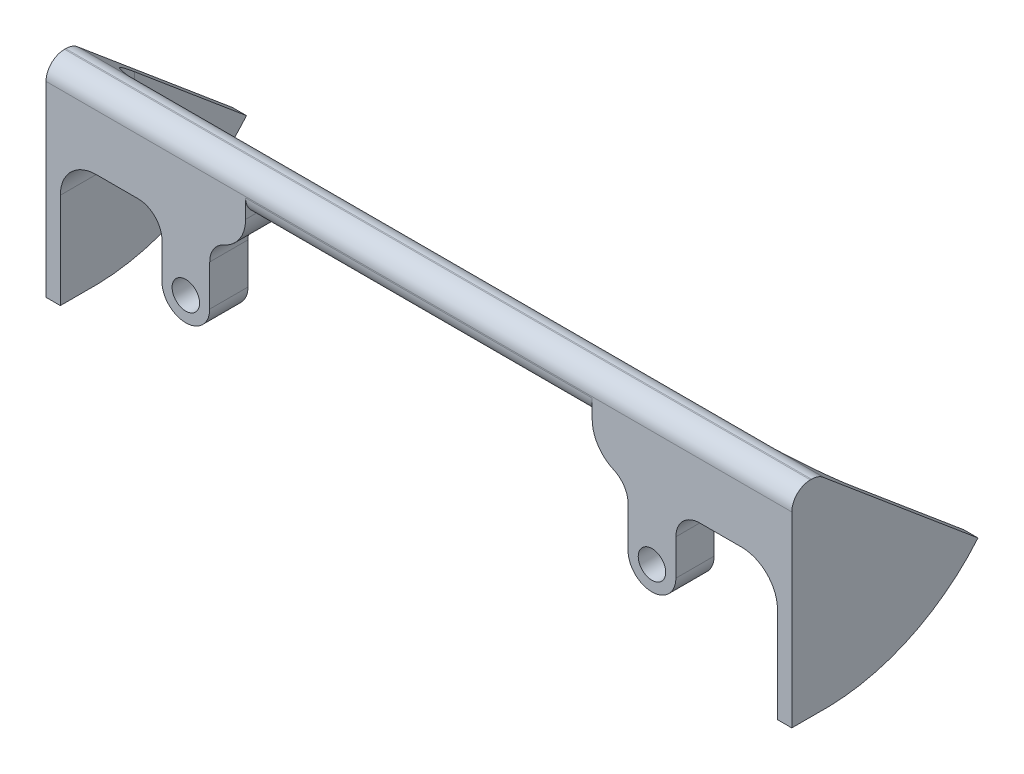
ISO-10303-21;
HEADER;
FILE_DESCRIPTION(('STEP AP214'),'2;1');
FILE_NAME('part.step','',(''),(''),'','','');
FILE_SCHEMA(('AUTOMOTIVE_DESIGN { 1 0 10303 214 1 1 1 1 }'));
ENDSEC;
DATA;
#1=APPLICATION_CONTEXT('core data for automotive mechanical design processes');
#2=APPLICATION_PROTOCOL_DEFINITION('international standard','automotive_design',2000,#1);
#3=PRODUCT_CONTEXT('',#1,'mechanical');
#4=PRODUCT('Part','Part','',(#3));
#5=PRODUCT_RELATED_PRODUCT_CATEGORY('part','',(#4));
#6=PRODUCT_DEFINITION_FORMATION('','',#4);
#7=PRODUCT_DEFINITION_CONTEXT('part definition',#1,'design');
#8=PRODUCT_DEFINITION('design','',#6,#7);
#9=PRODUCT_DEFINITION_SHAPE('','',#8);
#10=(LENGTH_UNIT() NAMED_UNIT(*) SI_UNIT(.MILLI.,.METRE.));
#11=(NAMED_UNIT(*) PLANE_ANGLE_UNIT() SI_UNIT($,.RADIAN.));
#12=(NAMED_UNIT(*) SI_UNIT($,.STERADIAN.) SOLID_ANGLE_UNIT());
#13=UNCERTAINTY_MEASURE_WITH_UNIT(LENGTH_MEASURE(1.E-05),#10,'distance_accuracy_value','');
#14=(GEOMETRIC_REPRESENTATION_CONTEXT(3) GLOBAL_UNCERTAINTY_ASSIGNED_CONTEXT((#13)) GLOBAL_UNIT_ASSIGNED_CONTEXT((#10,
#11,#12)) REPRESENTATION_CONTEXT('',''));
#15=CARTESIAN_POINT('',(0.,0.,0.));
#16=DIRECTION('',(0.,0.,1.));
#17=DIRECTION('',(1.,0.,0.));
#18=AXIS2_PLACEMENT_3D('',#15,#16,#17);
#19=CARTESIAN_POINT('',(30.,-3.,3.2));
#20=DIRECTION('',(0.,1.,0.));
#21=DIRECTION('',(-1.,0.,0.));
#22=AXIS2_PLACEMENT_3D('',#19,#20,#21);
#23=PLANE('',#22);
#24=DIRECTION('',(1.,0.,0.));
#25=VECTOR('',#24,1.);
#26=CARTESIAN_POINT('',(30.,-3.,3.2));
#27=LINE('',#26,#25);
#28=CARTESIAN_POINT('',(23.5,-3.,3.2));
#29=VERTEX_POINT('',#28);
#30=CARTESIAN_POINT('',(27.,-3.,3.2));
#31=VERTEX_POINT('',#30);
#32=EDGE_CURVE('E347',#29,#31,#27,.T.);
#33=ORIENTED_EDGE('',*,*,#32,.F.);
#34=DIRECTION('',(0.,0.,1.));
#35=VECTOR('',#34,1.);
#36=CARTESIAN_POINT('',(23.5,-3.,0.));
#37=LINE('',#36,#35);
#38=CARTESIAN_POINT('',(23.5,-3.,0.));
#39=VERTEX_POINT('',#38);
#40=EDGE_CURVE('E638',#29,#39,#37,.F.);
#41=ORIENTED_EDGE('',*,*,#40,.T.);
#42=DIRECTION('',(1.,0.,0.));
#43=VECTOR('',#42,1.);
#44=CARTESIAN_POINT('',(30.,-3.,0.));
#45=LINE('',#44,#43);
#46=CARTESIAN_POINT('',(27.,-3.,0.));
#47=VERTEX_POINT('',#46);
#48=EDGE_CURVE('E329',#39,#47,#45,.T.);
#49=ORIENTED_EDGE('',*,*,#48,.T.);
#50=DIRECTION('',(0.,0.,-1.));
#51=VECTOR('',#50,1.);
#52=CARTESIAN_POINT('',(27.,-3.,3.2));
#53=LINE('',#52,#51);
#54=EDGE_CURVE('E438',#47,#31,#53,.F.);
#55=ORIENTED_EDGE('',*,*,#54,.T.);
#56=EDGE_LOOP('',(#33,#41,#49,#55));
#57=FACE_BOUND('',#56,.T.);
#58=ADVANCED_FACE('F35',(#57),#23,.F.);
#59=CARTESIAN_POINT('',(14.5,0.,3.2));
#60=DIRECTION('',(1.,0.,0.));
#61=DIRECTION('',(0.,1.,0.));
#62=AXIS2_PLACEMENT_3D('',#59,#60,#61);
#63=PLANE('',#62);
#64=DIRECTION('',(0.,-1.,0.));
#65=VECTOR('',#64,1.);
#66=CARTESIAN_POINT('',(14.5,0.,0.));
#67=LINE('',#66,#65);
#68=CARTESIAN_POINT('',(14.5,1.55,0.));
#69=VERTEX_POINT('',#68);
#70=CARTESIAN_POINT('',(14.5,0.,0.));
#71=VERTEX_POINT('',#70);
#72=EDGE_CURVE('E361',#69,#71,#67,.T.);
#73=ORIENTED_EDGE('',*,*,#72,.T.);
#74=DIRECTION('',(0.,0.,-1.));
#75=VECTOR('',#74,1.);
#76=CARTESIAN_POINT('',(14.5,0.,3.2));
#77=LINE('',#76,#75);
#78=CARTESIAN_POINT('',(14.5,0.,1.55));
#79=VERTEX_POINT('',#78);
#80=EDGE_CURVE('E594',#71,#79,#77,.F.);
#81=ORIENTED_EDGE('',*,*,#80,.T.);
#82=CARTESIAN_POINT('',(14.5,1.55,1.55));
#83=DIRECTION('',(1.,0.,0.));
#84=DIRECTION('',(0.,1.,0.));
#85=AXIS2_PLACEMENT_3D('',#82,#83,#84);
#86=CIRCLE('',#85,1.55);
#87=EDGE_CURVE('E423',#79,#69,#86,.T.);
#88=ORIENTED_EDGE('',*,*,#87,.T.);
#89=EDGE_LOOP('',(#73,#81,#88));
#90=FACE_BOUND('',#89,.T.);
#91=ADVANCED_FACE('F504',(#90),#63,.F.);
#92=CARTESIAN_POINT('',(-14.5,0.,3.2));
#93=DIRECTION('',(-1.,0.,0.));
#94=DIRECTION('',(0.,-1.,0.));
#95=AXIS2_PLACEMENT_3D('',#92,#93,#94);
#96=PLANE('',#95);
#97=DIRECTION('',(0.,1.,0.));
#98=VECTOR('',#97,1.);
#99=CARTESIAN_POINT('',(-14.5,0.,3.2));
#100=LINE('',#99,#98);
#101=CARTESIAN_POINT('',(-14.5,0.,3.2));
#102=VERTEX_POINT('',#101);
#103=CARTESIAN_POINT('',(-14.5,1.55,3.2));
#104=VERTEX_POINT('',#103);
#105=EDGE_CURVE('E342',#102,#104,#100,.T.);
#106=ORIENTED_EDGE('',*,*,#105,.F.);
#107=DIRECTION('',(0.,0.,-1.));
#108=VECTOR('',#107,1.);
#109=CARTESIAN_POINT('',(-14.5,0.,3.2));
#110=LINE('',#109,#108);
#111=CARTESIAN_POINT('',(-14.5,0.,1.65));
#112=VERTEX_POINT('',#111);
#113=EDGE_CURVE('E572',#102,#112,#110,.T.);
#114=ORIENTED_EDGE('',*,*,#113,.T.);
#115=CARTESIAN_POINT('',(-14.5,1.55,1.65));
#116=DIRECTION('',(-1.,0.,0.));
#117=DIRECTION('',(0.,-1.,0.));
#118=AXIS2_PLACEMENT_3D('',#115,#116,#117);
#119=CIRCLE('',#118,1.55);
#120=EDGE_CURVE('E420',#112,#104,#119,.T.);
#121=ORIENTED_EDGE('',*,*,#120,.T.);
#122=EDGE_LOOP('',(#106,#114,#121));
#123=FACE_BOUND('',#122,.T.);
#124=ADVANCED_FACE('F497',(#123),#96,.F.);
#125=CARTESIAN_POINT('',(0.,0.,0.));
#126=DIRECTION('',(0.,0.,1.));
#127=DIRECTION('',(1.,0.,0.));
#128=AXIS2_PLACEMENT_3D('',#125,#126,#127);
#129=PLANE('',#128);
#130=DIRECTION('',(0.,1.,0.));
#131=VECTOR('',#130,1.);
#132=CARTESIAN_POINT('',(21.5,-3.,0.));
#133=LINE('',#132,#131);
#134=CARTESIAN_POINT('',(21.5,-8.,0.));
#135=VERTEX_POINT('',#134);
#136=CARTESIAN_POINT('',(21.5,-5.,0.));
#137=VERTEX_POINT('',#136);
#138=EDGE_CURVE('E663',#135,#137,#133,.T.);
#139=ORIENTED_EDGE('',*,*,#138,.F.);
#140=CARTESIAN_POINT('',(19.5,-8.,0.));
#141=DIRECTION('',(0.,0.,1.));
#142=DIRECTION('',(1.,0.,0.));
#143=AXIS2_PLACEMENT_3D('',#140,#141,#142);
#144=CIRCLE('',#143,2.);
#145=CARTESIAN_POINT('',(19.5,-10.,0.));
#146=VERTEX_POINT('',#145);
#147=EDGE_CURVE('E645',#135,#146,#144,.F.);
#148=ORIENTED_EDGE('',*,*,#147,.T.);
#149=CARTESIAN_POINT('',(19.5,-8.,0.));
#150=DIRECTION('',(0.,0.,1.));
#151=DIRECTION('',(1.,0.,0.));
#152=AXIS2_PLACEMENT_3D('',#149,#150,#151);
#153=CIRCLE('',#152,2.);
#154=CARTESIAN_POINT('',(17.5,-8.,0.));
#155=VERTEX_POINT('',#154);
#156=EDGE_CURVE('E56',#146,#155,#153,.F.);
#157=ORIENTED_EDGE('',*,*,#156,.T.);
#158=DIRECTION('',(0.,-1.,0.));
#159=VECTOR('',#158,1.);
#160=CARTESIAN_POINT('',(17.5,-3.,0.));
#161=LINE('',#160,#159);
#162=CARTESIAN_POINT('',(17.5,-4.58257569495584,0.));
#163=VERTEX_POINT('',#162);
#164=EDGE_CURVE('E745',#163,#155,#161,.T.);
#165=ORIENTED_EDGE('',*,*,#164,.F.);
#166=CARTESIAN_POINT('',(15.5,-4.58257569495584,0.));
#167=DIRECTION('',(0.,0.,1.));
#168=DIRECTION('',(1.,0.,0.));
#169=AXIS2_PLACEMENT_3D('',#166,#167,#168);
#170=CIRCLE('',#169,2.);
#171=CARTESIAN_POINT('',(16.3,-2.7495454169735,0.));
#172=VERTEX_POINT('',#171);
#173=EDGE_CURVE('E44',#163,#172,#170,.T.);
#174=ORIENTED_EDGE('',*,*,#173,.T.);
#175=CARTESIAN_POINT('',(17.5,0.,0.));
#176=DIRECTION('',(0.,0.,1.));
#177=DIRECTION('',(1.,0.,0.));
#178=AXIS2_PLACEMENT_3D('',#175,#176,#177);
#179=CIRCLE('',#178,3.);
#180=EDGE_CURVE('E577',#172,#71,#179,.F.);
#181=ORIENTED_EDGE('',*,*,#180,.T.);
#182=ORIENTED_EDGE('',*,*,#72,.F.);
#183=DIRECTION('',(1.,0.,0.));
#184=VECTOR('',#183,1.);
#185=CARTESIAN_POINT('',(0.,1.55,0.));
#186=LINE('',#185,#184);
#187=CARTESIAN_POINT('',(-14.5,1.55,0.));
#188=VERTEX_POINT('',#187);
#189=EDGE_CURVE('E412',#69,#188,#186,.F.);
#190=ORIENTED_EDGE('',*,*,#189,.T.);
#191=DIRECTION('',(0.,1.,0.));
#192=VECTOR('',#191,1.);
#193=CARTESIAN_POINT('',(-14.5,0.,0.));
#194=LINE('',#193,#192);
#195=CARTESIAN_POINT('',(-14.5,0.,0.));
#196=VERTEX_POINT('',#195);
#197=EDGE_CURVE('E359',#196,#188,#194,.T.);
#198=ORIENTED_EDGE('',*,*,#197,.F.);
#199=CARTESIAN_POINT('',(-17.5,0.,0.));
#200=DIRECTION('',(0.,0.,1.));
#201=DIRECTION('',(1.,0.,0.));
#202=AXIS2_PLACEMENT_3D('',#199,#200,#201);
#203=CIRCLE('',#202,3.);
#204=CARTESIAN_POINT('',(-16.3,-2.7495454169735,0.));
#205=VERTEX_POINT('',#204);
#206=EDGE_CURVE('E579',#196,#205,#203,.F.);
#207=ORIENTED_EDGE('',*,*,#206,.T.);
#208=CARTESIAN_POINT('',(-15.5,-4.58257569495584,0.));
#209=DIRECTION('',(0.,0.,1.));
#210=DIRECTION('',(1.,0.,0.));
#211=AXIS2_PLACEMENT_3D('',#208,#209,#210);
#212=CIRCLE('',#211,2.);
#213=CARTESIAN_POINT('',(-17.5,-4.58257569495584,0.));
#214=VERTEX_POINT('',#213);
#215=EDGE_CURVE('E625',#205,#214,#212,.T.);
#216=ORIENTED_EDGE('',*,*,#215,.T.);
#217=DIRECTION('',(0.,-1.,0.));
#218=VECTOR('',#217,1.);
#219=CARTESIAN_POINT('',(-17.5,-3.,0.));
#220=LINE('',#219,#218);
#221=CARTESIAN_POINT('',(-17.5,-8.,0.));
#222=VERTEX_POINT('',#221);
#223=EDGE_CURVE('E729',#214,#222,#220,.T.);
#224=ORIENTED_EDGE('',*,*,#223,.T.);
#225=CARTESIAN_POINT('',(-19.5,-8.,0.));
#226=DIRECTION('',(0.,0.,1.));
#227=DIRECTION('',(1.,0.,0.));
#228=AXIS2_PLACEMENT_3D('',#225,#226,#227);
#229=CIRCLE('',#228,2.);
#230=CARTESIAN_POINT('',(-19.5,-10.,0.));
#231=VERTEX_POINT('',#230);
#232=EDGE_CURVE('E608',#222,#231,#229,.F.);
#233=ORIENTED_EDGE('',*,*,#232,.T.);
#234=CARTESIAN_POINT('',(-19.5,-8.,0.));
#235=DIRECTION('',(0.,0.,1.));
#236=DIRECTION('',(1.,0.,0.));
#237=AXIS2_PLACEMENT_3D('',#234,#235,#236);
#238=CIRCLE('',#237,2.);
#239=CARTESIAN_POINT('',(-21.5,-8.,0.));
#240=VERTEX_POINT('',#239);
#241=EDGE_CURVE('E610',#231,#240,#238,.F.);
#242=ORIENTED_EDGE('',*,*,#241,.T.);
#243=DIRECTION('',(0.,1.,0.));
#244=VECTOR('',#243,1.);
#245=CARTESIAN_POINT('',(-21.5,-3.,0.));
#246=LINE('',#245,#244);
#247=CARTESIAN_POINT('',(-21.5,-5.,0.));
#248=VERTEX_POINT('',#247);
#249=EDGE_CURVE('E733',#240,#248,#246,.T.);
#250=ORIENTED_EDGE('',*,*,#249,.T.);
#251=CARTESIAN_POINT('',(-23.5,-5.,0.));
#252=DIRECTION('',(0.,0.,1.));
#253=DIRECTION('',(1.,0.,0.));
#254=AXIS2_PLACEMENT_3D('',#251,#252,#253);
#255=CIRCLE('',#254,2.);
#256=CARTESIAN_POINT('',(-23.5,-3.,0.));
#257=VERTEX_POINT('',#256);
#258=EDGE_CURVE('E621',#248,#257,#255,.T.);
#259=ORIENTED_EDGE('',*,*,#258,.T.);
#260=DIRECTION('',(1.,0.,0.));
#261=VECTOR('',#260,1.);
#262=CARTESIAN_POINT('',(-30.,-3.,0.));
#263=LINE('',#262,#261);
#264=CARTESIAN_POINT('',(-27.,-3.,0.));
#265=VERTEX_POINT('',#264);
#266=EDGE_CURVE('E356',#265,#257,#263,.T.);
#267=ORIENTED_EDGE('',*,*,#266,.F.);
#268=DIRECTION('',(0.,-1.,0.));
#269=VECTOR('',#268,1.);
#270=CARTESIAN_POINT('',(-27.,1.64999999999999,0.));
#271=LINE('',#270,#269);
#272=CARTESIAN_POINT('',(-27.,1.64999999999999,0.));
#273=VERTEX_POINT('',#272);
#274=EDGE_CURVE('E450',#265,#273,#271,.F.);
#275=ORIENTED_EDGE('',*,*,#274,.T.);
#276=DIRECTION('',(-1.,0.,0.));
#277=VECTOR('',#276,1.);
#278=CARTESIAN_POINT('',(0.,1.64999999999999,0.));
#279=LINE('',#278,#277);
#280=CARTESIAN_POINT('',(27.,1.64999999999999,0.));
#281=VERTEX_POINT('',#280);
#282=EDGE_CURVE('E415',#273,#281,#279,.F.);
#283=ORIENTED_EDGE('',*,*,#282,.T.);
#284=DIRECTION('',(0.,1.,0.));
#285=VECTOR('',#284,1.);
#286=CARTESIAN_POINT('',(27.,-3.,0.));
#287=LINE('',#286,#285);
#288=EDGE_CURVE('E447',#281,#47,#287,.F.);
#289=ORIENTED_EDGE('',*,*,#288,.T.);
#290=ORIENTED_EDGE('',*,*,#48,.F.);
#291=CARTESIAN_POINT('',(23.5,-5.,0.));
#292=DIRECTION('',(0.,0.,1.));
#293=DIRECTION('',(1.,0.,0.));
#294=AXIS2_PLACEMENT_3D('',#291,#292,#293);
#295=CIRCLE('',#294,2.);
#296=EDGE_CURVE('E656',#39,#137,#295,.T.);
#297=ORIENTED_EDGE('',*,*,#296,.T.);
#298=EDGE_LOOP('',(#139,#148,#157,#165,#174,#181,#182,#190,#198,#207,#216,#224,#233,#242,#250,
#259,#267,#275,#283,#289,#290,#297));
#299=FACE_BOUND('',#298,.T.);
#300=CARTESIAN_POINT('',(-19.5,-8.,0.));
#301=DIRECTION('',(0.,0.,1.));
#302=DIRECTION('',(1.,0.,0.));
#303=AXIS2_PLACEMENT_3D('',#300,#301,#302);
#304=CIRCLE('',#303,1.15);
#305=CARTESIAN_POINT('',(-18.35,-8.,0.));
#306=VERTEX_POINT('',#305);
#307=EDGE_CURVE('E700',#306,#306,#304,.F.);
#308=ORIENTED_EDGE('',*,*,#307,.F.);
#309=EDGE_LOOP('',(#308));
#310=FACE_BOUND('',#309,.T.);
#311=CARTESIAN_POINT('',(19.5,-8.,0.));
#312=DIRECTION('',(0.,0.,1.));
#313=DIRECTION('',(1.,0.,0.));
#314=AXIS2_PLACEMENT_3D('',#311,#312,#313);
#315=CIRCLE('',#314,1.15);
#316=CARTESIAN_POINT('',(20.65,-8.,0.));
#317=VERTEX_POINT('',#316);
#318=EDGE_CURVE('E632',#317,#317,#315,.T.);
#319=ORIENTED_EDGE('',*,*,#318,.T.);
#320=EDGE_LOOP('',(#319));
#321=FACE_BOUND('',#320,.T.);
#322=ADVANCED_FACE('F493',(#299,#310,#321),#129,.F.);
#323=CARTESIAN_POINT('',(31.2,1.64999999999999,1.55));
#324=DIRECTION('',(-1.,0.,0.));
#325=DIRECTION('',(0.,0.,1.));
#326=AXIS2_PLACEMENT_3D('',#323,#324,#325);
#327=CYLINDRICAL_SURFACE('',#326,1.55);
#328=ORIENTED_EDGE('',*,*,#282,.F.);
#329=CARTESIAN_POINT('',(-27.,1.64999999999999,1.55));
#330=DIRECTION('',(-1.,0.,0.));
#331=DIRECTION('',(0.,0.,1.));
#332=AXIS2_PLACEMENT_3D('',#329,#330,#331);
#333=CIRCLE('',#332,1.55);
#334=CARTESIAN_POINT('',(-27.,2.74601551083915,0.453984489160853));
#335=VERTEX_POINT('',#334);
#336=EDGE_CURVE('E431',#273,#335,#333,.F.);
#337=ORIENTED_EDGE('',*,*,#336,.T.);
#338=DIRECTION('',(1.,0.,0.));
#339=VECTOR('',#338,1.);
#340=CARTESIAN_POINT('',(-52.2976893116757,2.74601551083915,0.453984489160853));
#341=LINE('',#340,#339);
#342=CARTESIAN_POINT('',(-31.2,2.74601551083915,0.453984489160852));
#343=VERTEX_POINT('',#342);
#344=EDGE_CURVE('E296',#343,#335,#341,.T.);
#345=ORIENTED_EDGE('',*,*,#344,.F.);
#346=CARTESIAN_POINT('',(-31.2,1.64999999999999,1.55));
#347=DIRECTION('',(1.,0.,0.));
#348=DIRECTION('',(0.,0.,-1.));
#349=AXIS2_PLACEMENT_3D('',#346,#347,#348);
#350=CIRCLE('',#349,1.55);
#351=CARTESIAN_POINT('',(-31.2,3.19999999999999,1.55));
#352=VERTEX_POINT('',#351);
#353=EDGE_CURVE('E398',#352,#343,#350,.F.);
#354=ORIENTED_EDGE('',*,*,#353,.F.);
#355=DIRECTION('',(-1.,0.,0.));
#356=VECTOR('',#355,1.);
#357=CARTESIAN_POINT('',(31.2,3.19999999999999,1.55));
#358=LINE('',#357,#356);
#359=CARTESIAN_POINT('',(31.2,3.19999999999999,1.55));
#360=VERTEX_POINT('',#359);
#361=EDGE_CURVE('E403',#360,#352,#358,.T.);
#362=ORIENTED_EDGE('',*,*,#361,.F.);
#363=CARTESIAN_POINT('',(31.2,1.64999999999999,1.55));
#364=DIRECTION('',(-1.,0.,0.));
#365=DIRECTION('',(0.,0.,1.));
#366=AXIS2_PLACEMENT_3D('',#363,#364,#365);
#367=CIRCLE('',#366,1.55);
#368=CARTESIAN_POINT('',(31.2,2.74601551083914,0.453984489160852));
#369=VERTEX_POINT('',#368);
#370=EDGE_CURVE('E408',#369,#360,#367,.F.);
#371=ORIENTED_EDGE('',*,*,#370,.F.);
#372=DIRECTION('',(1.,0.,0.));
#373=VECTOR('',#372,1.);
#374=CARTESIAN_POINT('',(8.90231068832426,2.74601551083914,0.453984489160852));
#375=LINE('',#374,#373);
#376=CARTESIAN_POINT('',(27.,2.74601551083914,0.453984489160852));
#377=VERTEX_POINT('',#376);
#378=EDGE_CURVE('E321',#377,#369,#375,.T.);
#379=ORIENTED_EDGE('',*,*,#378,.F.);
#380=CARTESIAN_POINT('',(27.,1.64999999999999,1.55));
#381=DIRECTION('',(1.,0.,0.));
#382=DIRECTION('',(0.,0.,-1.));
#383=AXIS2_PLACEMENT_3D('',#380,#381,#382);
#384=CIRCLE('',#383,1.55);
#385=EDGE_CURVE('E428',#377,#281,#384,.F.);
#386=ORIENTED_EDGE('',*,*,#385,.T.);
#387=EDGE_LOOP('',(#328,#337,#345,#354,#362,#371,#379,#386));
#388=FACE_BOUND('',#387,.T.);
#389=ADVANCED_FACE('F496',(#388),#327,.T.);
#390=CARTESIAN_POINT('',(30.,-14.,3.2));
#391=DIRECTION('',(0.,1.,0.));
#392=DIRECTION('',(0.,0.,1.));
#393=AXIS2_PLACEMENT_3D('',#390,#391,#392);
#394=PLANE('',#393);
#395=DIRECTION('',(1.,0.,0.));
#396=VECTOR('',#395,1.);
#397=CARTESIAN_POINT('',(30.,-14.,0.));
#398=LINE('',#397,#396);
#399=CARTESIAN_POINT('',(30.,-14.,0.));
#400=VERTEX_POINT('',#399);
#401=CARTESIAN_POINT('',(31.2,-14.,0.));
#402=VERTEX_POINT('',#401);
#403=EDGE_CURVE('E312',#400,#402,#398,.T.);
#404=ORIENTED_EDGE('',*,*,#403,.T.);
#405=DIRECTION('',(0.,0.,-1.));
#406=VECTOR('',#405,1.);
#407=CARTESIAN_POINT('',(31.2,-14.,3.2));
#408=LINE('',#407,#406);
#409=CARTESIAN_POINT('',(31.2,-14.,3.2));
#410=VERTEX_POINT('',#409);
#411=EDGE_CURVE('E383',#410,#402,#408,.T.);
#412=ORIENTED_EDGE('',*,*,#411,.F.);
#413=DIRECTION('',(1.,0.,0.));
#414=VECTOR('',#413,1.);
#415=CARTESIAN_POINT('',(30.,-14.,3.2));
#416=LINE('',#415,#414);
#417=CARTESIAN_POINT('',(30.,-14.,3.2));
#418=VERTEX_POINT('',#417);
#419=EDGE_CURVE('E325',#418,#410,#416,.T.);
#420=ORIENTED_EDGE('',*,*,#419,.F.);
#421=DIRECTION('',(0.,0.,-1.));
#422=VECTOR('',#421,1.);
#423=CARTESIAN_POINT('',(30.,-14.,3.2));
#424=LINE('',#423,#422);
#425=EDGE_CURVE('E351',#418,#400,#424,.T.);
#426=ORIENTED_EDGE('',*,*,#425,.T.);
#427=EDGE_LOOP('',(#404,#412,#420,#426));
#428=FACE_BOUND('',#427,.T.);
#429=ADVANCED_FACE('F538',(#428),#394,.F.);
#430=CARTESIAN_POINT('',(31.2,-14.,3.2));
#431=DIRECTION('',(-1.,0.,0.));
#432=DIRECTION('',(0.,0.,1.));
#433=AXIS2_PLACEMENT_3D('',#430,#431,#432);
#434=PLANE('',#433);
#435=DIRECTION('',(0.,-0.642787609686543,-0.766044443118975));
#436=VECTOR('',#435,1.);
#437=CARTESIAN_POINT('',(31.2,2.74601551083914,0.453984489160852));
#438=LINE('',#437,#436);
#439=CARTESIAN_POINT('',(31.2,-8.02207060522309,-12.37892082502));
#440=VERTEX_POINT('',#439);
#441=EDGE_CURVE('E314',#369,#440,#438,.T.);
#442=ORIENTED_EDGE('',*,*,#441,.F.);
#443=ORIENTED_EDGE('',*,*,#370,.T.);
#444=DIRECTION('',(0.,0.,-1.));
#445=VECTOR('',#444,1.);
#446=CARTESIAN_POINT('',(31.2,3.19999999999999,3.2));
#447=LINE('',#446,#445);
#448=CARTESIAN_POINT('',(31.2,3.19999999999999,1.65));
#449=VERTEX_POINT('',#448);
#450=EDGE_CURVE('E380',#449,#360,#447,.T.);
#451=ORIENTED_EDGE('',*,*,#450,.F.);
#452=CARTESIAN_POINT('',(31.2,1.64999999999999,1.65));
#453=DIRECTION('',(-1.,0.,0.));
#454=DIRECTION('',(0.,0.,1.));
#455=AXIS2_PLACEMENT_3D('',#452,#453,#454);
#456=CIRCLE('',#455,1.55);
#457=CARTESIAN_POINT('',(31.2,1.64999999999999,3.2));
#458=VERTEX_POINT('',#457);
#459=EDGE_CURVE('E410',#449,#458,#456,.F.);
#460=ORIENTED_EDGE('',*,*,#459,.T.);
#461=DIRECTION('',(0.,1.,0.));
#462=VECTOR('',#461,1.);
#463=CARTESIAN_POINT('',(31.2,-14.,3.2));
#464=LINE('',#463,#462);
#465=EDGE_CURVE('E328',#410,#458,#464,.T.);
#466=ORIENTED_EDGE('',*,*,#465,.F.);
#467=ORIENTED_EDGE('',*,*,#411,.T.);
#468=CARTESIAN_POINT('',(31.2,2.74601551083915,0.453984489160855));
#469=DIRECTION('',(-1.,0.,0.));
#470=DIRECTION('',(0.,0.,1.));
#471=AXIS2_PLACEMENT_3D('',#468,#469,#470);
#472=CIRCLE('',#471,16.7521681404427);
#473=EDGE_CURVE('E317',#440,#402,#472,.T.);
#474=ORIENTED_EDGE('',*,*,#473,.F.);
#475=EDGE_LOOP('',(#442,#443,#451,#460,#466,#467,#474));
#476=FACE_BOUND('',#475,.T.);
#477=ADVANCED_FACE('F534',(#476),#434,.F.);
#478=CARTESIAN_POINT('',(31.2,3.19999999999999,3.2));
#479=DIRECTION('',(0.,-1.,0.));
#480=DIRECTION('',(0.,0.,-1.));
#481=AXIS2_PLACEMENT_3D('',#478,#479,#480);
#482=PLANE('',#481);
#483=DIRECTION('',(0.,0.,-1.));
#484=VECTOR('',#483,1.);
#485=CARTESIAN_POINT('',(-31.2,3.19999999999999,3.2));
#486=LINE('',#485,#484);
#487=CARTESIAN_POINT('',(-31.2,3.19999999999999,1.65));
#488=VERTEX_POINT('',#487);
#489=EDGE_CURVE('E377',#488,#352,#486,.T.);
#490=ORIENTED_EDGE('',*,*,#489,.F.);
#491=DIRECTION('',(-1.,0.,0.));
#492=VECTOR('',#491,1.);
#493=CARTESIAN_POINT('',(31.2,3.19999999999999,1.65));
#494=LINE('',#493,#492);
#495=EDGE_CURVE('E406',#488,#449,#494,.F.);
#496=ORIENTED_EDGE('',*,*,#495,.T.);
#497=ORIENTED_EDGE('',*,*,#450,.T.);
#498=ORIENTED_EDGE('',*,*,#361,.T.);
#499=EDGE_LOOP('',(#490,#496,#497,#498));
#500=FACE_BOUND('',#499,.T.);
#501=ADVANCED_FACE('F530',(#500),#482,.F.);
#502=CARTESIAN_POINT('',(-31.2,3.19999999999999,3.2));
#503=DIRECTION('',(1.,0.,0.));
#504=DIRECTION('',(0.,0.,-1.));
#505=AXIS2_PLACEMENT_3D('',#502,#503,#504);
#506=PLANE('',#505);
#507=CARTESIAN_POINT('',(-31.2,2.74601551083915,0.453984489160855));
#508=DIRECTION('',(1.,0.,0.));
#509=DIRECTION('',(0.,0.,-1.));
#510=AXIS2_PLACEMENT_3D('',#507,#508,#509);
#511=CIRCLE('',#510,16.7521681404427);
#512=CARTESIAN_POINT('',(-31.2,-14.,0.));
#513=VERTEX_POINT('',#512);
#514=CARTESIAN_POINT('',(-31.2,-8.02207060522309,-12.37892082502));
#515=VERTEX_POINT('',#514);
#516=EDGE_CURVE('E295',#513,#515,#511,.T.);
#517=ORIENTED_EDGE('',*,*,#516,.F.);
#518=DIRECTION('',(0.,0.,-1.));
#519=VECTOR('',#518,1.);
#520=CARTESIAN_POINT('',(-31.2,-14.,3.2));
#521=LINE('',#520,#519);
#522=CARTESIAN_POINT('',(-31.2,-14.,3.2));
#523=VERTEX_POINT('',#522);
#524=EDGE_CURVE('E374',#523,#513,#521,.T.);
#525=ORIENTED_EDGE('',*,*,#524,.F.);
#526=DIRECTION('',(0.,-1.,0.));
#527=VECTOR('',#526,1.);
#528=CARTESIAN_POINT('',(-31.2,3.19999999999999,3.2));
#529=LINE('',#528,#527);
#530=CARTESIAN_POINT('',(-31.2,1.64999999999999,3.2));
#531=VERTEX_POINT('',#530);
#532=EDGE_CURVE('E332',#531,#523,#529,.T.);
#533=ORIENTED_EDGE('',*,*,#532,.F.);
#534=CARTESIAN_POINT('',(-31.2,1.64999999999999,1.65));
#535=DIRECTION('',(1.,0.,0.));
#536=DIRECTION('',(0.,0.,-1.));
#537=AXIS2_PLACEMENT_3D('',#534,#535,#536);
#538=CIRCLE('',#537,1.55);
#539=EDGE_CURVE('E401',#531,#488,#538,.F.);
#540=ORIENTED_EDGE('',*,*,#539,.T.);
#541=ORIENTED_EDGE('',*,*,#489,.T.);
#542=ORIENTED_EDGE('',*,*,#353,.T.);
#543=DIRECTION('',(0.,0.642787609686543,0.766044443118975));
#544=VECTOR('',#543,1.);
#545=CARTESIAN_POINT('',(-31.2,-2.82088602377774,-6.18039041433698));
#546=LINE('',#545,#544);
#547=EDGE_CURVE('E308',#515,#343,#546,.T.);
#548=ORIENTED_EDGE('',*,*,#547,.F.);
#549=EDGE_LOOP('',(#517,#525,#533,#540,#541,#542,#548));
#550=FACE_BOUND('',#549,.T.);
#551=ADVANCED_FACE('F526',(#550),#506,.F.);
#552=CARTESIAN_POINT('',(-31.2,-14.,3.2));
#553=DIRECTION('',(0.,1.,0.));
#554=DIRECTION('',(0.,0.,1.));
#555=AXIS2_PLACEMENT_3D('',#552,#553,#554);
#556=PLANE('',#555);
#557=DIRECTION('',(1.,0.,0.));
#558=VECTOR('',#557,1.);
#559=CARTESIAN_POINT('',(-31.2,-14.,0.));
#560=LINE('',#559,#558);
#561=CARTESIAN_POINT('',(-30.,-14.,0.));
#562=VERTEX_POINT('',#561);
#563=EDGE_CURVE('E354',#513,#562,#560,.T.);
#564=ORIENTED_EDGE('',*,*,#563,.T.);
#565=DIRECTION('',(0.,0.,-1.));
#566=VECTOR('',#565,1.);
#567=CARTESIAN_POINT('',(-30.,-14.,3.2));
#568=LINE('',#567,#566);
#569=CARTESIAN_POINT('',(-30.,-14.,3.2));
#570=VERTEX_POINT('',#569);
#571=EDGE_CURVE('E302',#570,#562,#568,.T.);
#572=ORIENTED_EDGE('',*,*,#571,.F.);
#573=DIRECTION('',(1.,0.,0.));
#574=VECTOR('',#573,1.);
#575=CARTESIAN_POINT('',(-31.2,-14.,3.2));
#576=LINE('',#575,#574);
#577=EDGE_CURVE('E334',#523,#570,#576,.T.);
#578=ORIENTED_EDGE('',*,*,#577,.F.);
#579=ORIENTED_EDGE('',*,*,#524,.T.);
#580=EDGE_LOOP('',(#564,#572,#578,#579));
#581=FACE_BOUND('',#580,.T.);
#582=ADVANCED_FACE('F523',(#581),#556,.F.);
#583=CARTESIAN_POINT('',(-30.,-14.,3.2));
#584=DIRECTION('',(-1.,0.,0.));
#585=DIRECTION('',(0.,0.,1.));
#586=AXIS2_PLACEMENT_3D('',#583,#584,#585);
#587=PLANE('',#586);
#588=DIRECTION('',(0.,-1.,0.));
#589=VECTOR('',#588,1.);
#590=CARTESIAN_POINT('',(-30.,-3.,-3.));
#591=LINE('',#590,#589);
#592=CARTESIAN_POINT('',(-30.,-0.152221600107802,-3.));
#593=VERTEX_POINT('',#592);
#594=CARTESIAN_POINT('',(-30.,-6.,-3.));
#595=VERTEX_POINT('',#594);
#596=EDGE_CURVE('E443',#593,#595,#591,.T.);
#597=ORIENTED_EDGE('',*,*,#596,.T.);
#598=DIRECTION('',(0.,0.,-1.));
#599=VECTOR('',#598,1.);
#600=CARTESIAN_POINT('',(-30.,-6.,3.2));
#601=LINE('',#600,#599);
#602=CARTESIAN_POINT('',(-30.,-6.,3.2));
#603=VERTEX_POINT('',#602);
#604=EDGE_CURVE('E445',#595,#603,#601,.F.);
#605=ORIENTED_EDGE('',*,*,#604,.T.);
#606=DIRECTION('',(0.,1.,0.));
#607=VECTOR('',#606,1.);
#608=CARTESIAN_POINT('',(-30.,-14.,3.2));
#609=LINE('',#608,#607);
#610=EDGE_CURVE('E336',#570,#603,#609,.T.);
#611=ORIENTED_EDGE('',*,*,#610,.F.);
#612=ORIENTED_EDGE('',*,*,#571,.T.);
#613=CARTESIAN_POINT('',(-30.,2.74601551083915,0.453984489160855));
#614=DIRECTION('',(-1.,0.,0.));
#615=DIRECTION('',(0.,0.,1.));
#616=AXIS2_PLACEMENT_3D('',#613,#614,#615);
#617=CIRCLE('',#616,16.7521681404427);
#618=CARTESIAN_POINT('',(-30.,-8.02207060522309,-12.37892082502));
#619=VERTEX_POINT('',#618);
#620=EDGE_CURVE('E288',#619,#562,#617,.T.);
#621=ORIENTED_EDGE('',*,*,#620,.F.);
#622=DIRECTION('',(0.,-0.642787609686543,-0.766044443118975));
#623=VECTOR('',#622,1.);
#624=CARTESIAN_POINT('',(-30.,-2.82088602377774,-6.18039041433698));
#625=LINE('',#624,#623);
#626=EDGE_CURVE('E278',#593,#619,#625,.T.);
#627=ORIENTED_EDGE('',*,*,#626,.F.);
#628=EDGE_LOOP('',(#597,#605,#611,#612,#621,#627));
#629=FACE_BOUND('',#628,.T.);
#630=ADVANCED_FACE('F299',(#629),#587,.F.);
#631=CARTESIAN_POINT('',(-30.,-3.,3.2));
#632=DIRECTION('',(0.,1.,0.));
#633=DIRECTION('',(-1.,0.,0.));
#634=AXIS2_PLACEMENT_3D('',#631,#632,#633);
#635=PLANE('',#634);
#636=ORIENTED_EDGE('',*,*,#266,.T.);
#637=DIRECTION('',(0.,0.,1.));
#638=VECTOR('',#637,1.);
#639=CARTESIAN_POINT('',(-23.5,-3.,3.2));
#640=LINE('',#639,#638);
#641=CARTESIAN_POINT('',(-23.5,-3.,3.2));
#642=VERTEX_POINT('',#641);
#643=EDGE_CURVE('E596',#257,#642,#640,.T.);
#644=ORIENTED_EDGE('',*,*,#643,.T.);
#645=DIRECTION('',(1.,0.,0.));
#646=VECTOR('',#645,1.);
#647=CARTESIAN_POINT('',(-30.,-3.,3.2));
#648=LINE('',#647,#646);
#649=CARTESIAN_POINT('',(-27.,-3.,3.2));
#650=VERTEX_POINT('',#649);
#651=EDGE_CURVE('E339',#650,#642,#648,.T.);
#652=ORIENTED_EDGE('',*,*,#651,.F.);
#653=DIRECTION('',(0.,0.,-1.));
#654=VECTOR('',#653,1.);
#655=CARTESIAN_POINT('',(-27.,-3.,0.));
#656=LINE('',#655,#654);
#657=EDGE_CURVE('E441',#650,#265,#656,.T.);
#658=ORIENTED_EDGE('',*,*,#657,.T.);
#659=EDGE_LOOP('',(#636,#644,#652,#658));
#660=FACE_BOUND('',#659,.T.);
#661=ADVANCED_FACE('F516',(#660),#635,.F.);
#662=CARTESIAN_POINT('',(-14.5,1.55,1.55));
#663=DIRECTION('',(-1.,0.,0.));
#664=DIRECTION('',(0.,-1.,0.));
#665=AXIS2_PLACEMENT_3D('',#662,#663,#664);
#666=CIRCLE('',#665,1.55);
#667=CARTESIAN_POINT('',(-14.5,0.,1.55));
#668=VERTEX_POINT('',#667);
#669=EDGE_CURVE('E426',#188,#668,#666,.T.);
#670=ORIENTED_EDGE('',*,*,#669,.T.);
#671=DIRECTION('',(0.,0.,-1.));
#672=VECTOR('',#671,1.);
#673=CARTESIAN_POINT('',(-14.5,0.,3.2));
#674=LINE('',#673,#672);
#675=EDGE_CURVE('E562',#668,#196,#674,.T.);
#676=ORIENTED_EDGE('',*,*,#675,.T.);
#677=ORIENTED_EDGE('',*,*,#197,.T.);
#678=EDGE_LOOP('',(#670,#676,#677));
#679=FACE_BOUND('',#678,.T.);
#680=ADVANCED_FACE('F512',(#679),#96,.F.);
#681=CARTESIAN_POINT('',(-14.5,0.,3.2));
#682=DIRECTION('',(0.,1.,0.));
#683=DIRECTION('',(0.,0.,1.));
#684=AXIS2_PLACEMENT_3D('',#681,#682,#683);
#685=PLANE('',#684);
#686=DIRECTION('',(0.,0.,-1.));
#687=VECTOR('',#686,1.);
#688=CARTESIAN_POINT('',(14.5,0.,3.2));
#689=LINE('',#688,#687);
#690=CARTESIAN_POINT('',(14.5,0.,1.65));
#691=VERTEX_POINT('',#690);
#692=EDGE_CURVE('E367',#691,#79,#689,.T.);
#693=ORIENTED_EDGE('',*,*,#692,.F.);
#694=DIRECTION('',(1.,0.,0.));
#695=VECTOR('',#694,1.);
#696=CARTESIAN_POINT('',(-14.5,0.,1.65));
#697=LINE('',#696,#695);
#698=EDGE_CURVE('E395',#691,#112,#697,.F.);
#699=ORIENTED_EDGE('',*,*,#698,.T.);
#700=DIRECTION('',(0.,0.,-1.));
#701=VECTOR('',#700,1.);
#702=CARTESIAN_POINT('',(-14.5,0.,3.2));
#703=LINE('',#702,#701);
#704=EDGE_CURVE('E370',#112,#668,#703,.T.);
#705=ORIENTED_EDGE('',*,*,#704,.T.);
#706=DIRECTION('',(1.,0.,0.));
#707=VECTOR('',#706,1.);
#708=CARTESIAN_POINT('',(-14.5,0.,1.55));
#709=LINE('',#708,#707);
#710=EDGE_CURVE('E392',#668,#79,#709,.T.);
#711=ORIENTED_EDGE('',*,*,#710,.T.);
#712=EDGE_LOOP('',(#693,#699,#705,#711));
#713=FACE_BOUND('',#712,.T.);
#714=ADVANCED_FACE('F508',(#713),#685,.F.);
#715=CARTESIAN_POINT('',(14.5,1.55,1.65));
#716=DIRECTION('',(1.,0.,0.));
#717=DIRECTION('',(0.,1.,0.));
#718=AXIS2_PLACEMENT_3D('',#715,#716,#717);
#719=CIRCLE('',#718,1.55);
#720=CARTESIAN_POINT('',(14.5,1.55,3.2));
#721=VERTEX_POINT('',#720);
#722=EDGE_CURVE('E418',#721,#691,#719,.T.);
#723=ORIENTED_EDGE('',*,*,#722,.T.);
#724=DIRECTION('',(0.,0.,-1.));
#725=VECTOR('',#724,1.);
#726=CARTESIAN_POINT('',(14.5,0.,3.2));
#727=LINE('',#726,#725);
#728=CARTESIAN_POINT('',(14.5,0.,3.2));
#729=VERTEX_POINT('',#728);
#730=EDGE_CURVE('E592',#691,#729,#727,.F.);
#731=ORIENTED_EDGE('',*,*,#730,.T.);
#732=DIRECTION('',(0.,-1.,0.));
#733=VECTOR('',#732,1.);
#734=CARTESIAN_POINT('',(14.5,0.,3.2));
#735=LINE('',#734,#733);
#736=EDGE_CURVE('E344',#721,#729,#735,.T.);
#737=ORIENTED_EDGE('',*,*,#736,.F.);
#738=EDGE_LOOP('',(#723,#731,#737));
#739=FACE_BOUND('',#738,.T.);
#740=ADVANCED_FACE('F500',(#739),#63,.F.);
#741=CARTESIAN_POINT('',(30.,-3.,3.2));
#742=DIRECTION('',(1.,0.,0.));
#743=DIRECTION('',(0.,0.,-1.));
#744=AXIS2_PLACEMENT_3D('',#741,#742,#743);
#745=PLANE('',#744);
#746=DIRECTION('',(0.,-1.,0.));
#747=VECTOR('',#746,1.);
#748=CARTESIAN_POINT('',(30.,-3.,3.2));
#749=LINE('',#748,#747);
#750=CARTESIAN_POINT('',(30.,-6.,3.2));
#751=VERTEX_POINT('',#750);
#752=EDGE_CURVE('E349',#751,#418,#749,.T.);
#753=ORIENTED_EDGE('',*,*,#752,.F.);
#754=DIRECTION('',(0.,0.,-1.));
#755=VECTOR('',#754,1.);
#756=CARTESIAN_POINT('',(30.,-6.,0.));
#757=LINE('',#756,#755);
#758=CARTESIAN_POINT('',(30.,-6.,-3.));
#759=VERTEX_POINT('',#758);
#760=EDGE_CURVE('E436',#751,#759,#757,.T.);
#761=ORIENTED_EDGE('',*,*,#760,.T.);
#762=DIRECTION('',(0.,1.,0.));
#763=VECTOR('',#762,1.);
#764=CARTESIAN_POINT('',(30.,1.64999999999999,-3.));
#765=LINE('',#764,#763);
#766=CARTESIAN_POINT('',(30.,-0.152221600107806,-3.));
#767=VERTEX_POINT('',#766);
#768=EDGE_CURVE('E434',#759,#767,#765,.T.);
#769=ORIENTED_EDGE('',*,*,#768,.T.);
#770=DIRECTION('',(0.,0.642787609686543,0.766044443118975));
#771=VECTOR('',#770,1.);
#772=CARTESIAN_POINT('',(30.,2.74601551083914,0.453984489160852));
#773=LINE('',#772,#771);
#774=CARTESIAN_POINT('',(30.,-8.02207060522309,-12.37892082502));
#775=VERTEX_POINT('',#774);
#776=EDGE_CURVE('E309',#775,#767,#773,.T.);
#777=ORIENTED_EDGE('',*,*,#776,.F.);
#778=CARTESIAN_POINT('',(30.,2.74601551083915,0.453984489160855));
#779=DIRECTION('',(1.,0.,0.));
#780=DIRECTION('',(0.,0.,-1.));
#781=AXIS2_PLACEMENT_3D('',#778,#779,#780);
#782=CIRCLE('',#781,16.7521681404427);
#783=EDGE_CURVE('E313',#400,#775,#782,.T.);
#784=ORIENTED_EDGE('',*,*,#783,.F.);
#785=ORIENTED_EDGE('',*,*,#425,.F.);
#786=EDGE_LOOP('',(#753,#761,#769,#777,#784,#785));
#787=FACE_BOUND('',#786,.T.);
#788=ADVANCED_FACE('F491',(#787),#745,.F.);
#789=CARTESIAN_POINT('',(0.,0.,3.2));
#790=DIRECTION('',(0.,0.,1.));
#791=DIRECTION('',(1.,0.,0.));
#792=AXIS2_PLACEMENT_3D('',#789,#790,#791);
#793=PLANE('',#792);
#794=CARTESIAN_POINT('',(19.5,-8.,3.2));
#795=DIRECTION('',(0.,0.,1.));
#796=DIRECTION('',(1.,0.,0.));
#797=AXIS2_PLACEMENT_3D('',#794,#795,#796);
#798=CIRCLE('',#797,2.);
#799=CARTESIAN_POINT('',(17.5,-8.,3.2));
#800=VERTEX_POINT('',#799);
#801=CARTESIAN_POINT('',(19.5,-10.,3.2));
#802=VERTEX_POINT('',#801);
#803=EDGE_CURVE('E640',#800,#802,#798,.T.);
#804=ORIENTED_EDGE('',*,*,#803,.T.);
#805=CARTESIAN_POINT('',(19.5,-8.,3.2));
#806=DIRECTION('',(0.,0.,1.));
#807=DIRECTION('',(1.,0.,0.));
#808=AXIS2_PLACEMENT_3D('',#805,#806,#807);
#809=CIRCLE('',#808,2.);
#810=CARTESIAN_POINT('',(21.5,-8.,3.2));
#811=VERTEX_POINT('',#810);
#812=EDGE_CURVE('E642',#802,#811,#809,.T.);
#813=ORIENTED_EDGE('',*,*,#812,.T.);
#814=DIRECTION('',(0.,-1.,0.));
#815=VECTOR('',#814,1.);
#816=CARTESIAN_POINT('',(21.5,-3.,3.2));
#817=LINE('',#816,#815);
#818=CARTESIAN_POINT('',(21.5,-5.,3.2));
#819=VERTEX_POINT('',#818);
#820=EDGE_CURVE('E672',#819,#811,#817,.T.);
#821=ORIENTED_EDGE('',*,*,#820,.F.);
#822=CARTESIAN_POINT('',(23.5,-5.,3.2));
#823=DIRECTION('',(0.,0.,1.));
#824=DIRECTION('',(1.,0.,0.));
#825=AXIS2_PLACEMENT_3D('',#822,#823,#824);
#826=CIRCLE('',#825,2.);
#827=EDGE_CURVE('E654',#819,#29,#826,.F.);
#828=ORIENTED_EDGE('',*,*,#827,.T.);
#829=ORIENTED_EDGE('',*,*,#32,.T.);
#830=CARTESIAN_POINT('',(27.,-6.,3.2));
#831=DIRECTION('',(0.,0.,1.));
#832=DIRECTION('',(1.,0.,0.));
#833=AXIS2_PLACEMENT_3D('',#830,#831,#832);
#834=CIRCLE('',#833,3.);
#835=EDGE_CURVE('E684',#31,#751,#834,.F.);
#836=ORIENTED_EDGE('',*,*,#835,.T.);
#837=ORIENTED_EDGE('',*,*,#752,.T.);
#838=ORIENTED_EDGE('',*,*,#419,.T.);
#839=ORIENTED_EDGE('',*,*,#465,.T.);
#840=DIRECTION('',(-1.,0.,0.));
#841=VECTOR('',#840,1.);
#842=CARTESIAN_POINT('',(-31.2,1.64999999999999,3.2));
#843=LINE('',#842,#841);
#844=EDGE_CURVE('E386',#458,#531,#843,.T.);
#845=ORIENTED_EDGE('',*,*,#844,.T.);
#846=ORIENTED_EDGE('',*,*,#532,.T.);
#847=ORIENTED_EDGE('',*,*,#577,.T.);
#848=ORIENTED_EDGE('',*,*,#610,.T.);
#849=CARTESIAN_POINT('',(-27.,-6.,3.2));
#850=DIRECTION('',(0.,0.,1.));
#851=DIRECTION('',(1.,0.,0.));
#852=AXIS2_PLACEMENT_3D('',#849,#850,#851);
#853=CIRCLE('',#852,3.);
#854=EDGE_CURVE('E687',#603,#650,#853,.F.);
#855=ORIENTED_EDGE('',*,*,#854,.T.);
#856=ORIENTED_EDGE('',*,*,#651,.T.);
#857=CARTESIAN_POINT('',(-23.5,-5.,3.2));
#858=DIRECTION('',(0.,0.,1.));
#859=DIRECTION('',(1.,0.,0.));
#860=AXIS2_PLACEMENT_3D('',#857,#858,#859);
#861=CIRCLE('',#860,2.);
#862=CARTESIAN_POINT('',(-21.5,-5.,3.2));
#863=VERTEX_POINT('',#862);
#864=EDGE_CURVE('E619',#642,#863,#861,.F.);
#865=ORIENTED_EDGE('',*,*,#864,.T.);
#866=DIRECTION('',(0.,-1.,0.));
#867=VECTOR('',#866,1.);
#868=CARTESIAN_POINT('',(-21.5,-3.,3.2));
#869=LINE('',#868,#867);
#870=CARTESIAN_POINT('',(-21.5,-8.,3.2));
#871=VERTEX_POINT('',#870);
#872=EDGE_CURVE('E730',#863,#871,#869,.T.);
#873=ORIENTED_EDGE('',*,*,#872,.T.);
#874=CARTESIAN_POINT('',(-19.5,-8.,3.2));
#875=DIRECTION('',(0.,0.,1.));
#876=DIRECTION('',(1.,0.,0.));
#877=AXIS2_PLACEMENT_3D('',#874,#875,#876);
#878=CIRCLE('',#877,2.);
#879=CARTESIAN_POINT('',(-19.5,-10.,3.2));
#880=VERTEX_POINT('',#879);
#881=EDGE_CURVE('E606',#871,#880,#878,.T.);
#882=ORIENTED_EDGE('',*,*,#881,.T.);
#883=CARTESIAN_POINT('',(-19.5,-8.,3.2));
#884=DIRECTION('',(0.,0.,1.));
#885=DIRECTION('',(1.,0.,0.));
#886=AXIS2_PLACEMENT_3D('',#883,#884,#885);
#887=CIRCLE('',#886,2.);
#888=CARTESIAN_POINT('',(-17.5,-8.,3.2));
#889=VERTEX_POINT('',#888);
#890=EDGE_CURVE('E604',#880,#889,#887,.T.);
#891=ORIENTED_EDGE('',*,*,#890,.T.);
#892=DIRECTION('',(0.,1.,0.));
#893=VECTOR('',#892,1.);
#894=CARTESIAN_POINT('',(-17.5,-3.,3.2));
#895=LINE('',#894,#893);
#896=CARTESIAN_POINT('',(-17.5,-4.58257569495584,3.2));
#897=VERTEX_POINT('',#896);
#898=EDGE_CURVE('E734',#889,#897,#895,.T.);
#899=ORIENTED_EDGE('',*,*,#898,.T.);
#900=CARTESIAN_POINT('',(-15.5,-4.58257569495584,3.2));
#901=DIRECTION('',(0.,0.,1.));
#902=DIRECTION('',(1.,0.,0.));
#903=AXIS2_PLACEMENT_3D('',#900,#901,#902);
#904=CIRCLE('',#903,2.);
#905=CARTESIAN_POINT('',(-16.3,-2.7495454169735,3.2));
#906=VERTEX_POINT('',#905);
#907=EDGE_CURVE('E623',#897,#906,#904,.F.);
#908=ORIENTED_EDGE('',*,*,#907,.T.);
#909=CARTESIAN_POINT('',(-17.5,0.,3.2));
#910=DIRECTION('',(0.,0.,1.));
#911=DIRECTION('',(1.,0.,0.));
#912=AXIS2_PLACEMENT_3D('',#909,#910,#911);
#913=CIRCLE('',#912,3.);
#914=EDGE_CURVE('E590',#906,#102,#913,.T.);
#915=ORIENTED_EDGE('',*,*,#914,.T.);
#916=ORIENTED_EDGE('',*,*,#105,.T.);
#917=DIRECTION('',(1.,0.,0.));
#918=VECTOR('',#917,1.);
#919=CARTESIAN_POINT('',(14.5,1.55,3.2));
#920=LINE('',#919,#918);
#921=EDGE_CURVE('E389',#104,#721,#920,.T.);
#922=ORIENTED_EDGE('',*,*,#921,.T.);
#923=ORIENTED_EDGE('',*,*,#736,.T.);
#924=CARTESIAN_POINT('',(17.5,0.,3.2));
#925=DIRECTION('',(0.,0.,1.));
#926=DIRECTION('',(1.,0.,0.));
#927=AXIS2_PLACEMENT_3D('',#924,#925,#926);
#928=CIRCLE('',#927,3.);
#929=CARTESIAN_POINT('',(16.3,-2.7495454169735,3.2));
#930=VERTEX_POINT('',#929);
#931=EDGE_CURVE('E587',#729,#930,#928,.T.);
#932=ORIENTED_EDGE('',*,*,#931,.T.);
#933=CARTESIAN_POINT('',(15.5,-4.58257569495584,3.2));
#934=DIRECTION('',(0.,0.,1.));
#935=DIRECTION('',(1.,0.,0.));
#936=AXIS2_PLACEMENT_3D('',#933,#934,#935);
#937=CIRCLE('',#936,2.);
#938=CARTESIAN_POINT('',(17.5,-4.58257569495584,3.2));
#939=VERTEX_POINT('',#938);
#940=EDGE_CURVE('E11',#930,#939,#937,.F.);
#941=ORIENTED_EDGE('',*,*,#940,.T.);
#942=DIRECTION('',(0.,1.,0.));
#943=VECTOR('',#942,1.);
#944=CARTESIAN_POINT('',(17.5,-3.,3.2));
#945=LINE('',#944,#943);
#946=EDGE_CURVE('E673',#800,#939,#945,.T.);
#947=ORIENTED_EDGE('',*,*,#946,.F.);
#948=EDGE_LOOP('',(#804,#813,#821,#828,#829,#836,#837,#838,#839,#845,#846,#847,#848,#855,#856,
#865,#873,#882,#891,#899,#908,#915,#916,#922,#923,#932,#941,#947));
#949=FACE_BOUND('',#948,.T.);
#950=CARTESIAN_POINT('',(-19.5,-8.,3.2));
#951=DIRECTION('',(0.,0.,1.));
#952=DIRECTION('',(1.,0.,0.));
#953=AXIS2_PLACEMENT_3D('',#950,#951,#952);
#954=CIRCLE('',#953,1.15);
#955=CARTESIAN_POINT('',(-18.35,-8.,3.2));
#956=VERTEX_POINT('',#955);
#957=EDGE_CURVE('E631',#956,#956,#954,.T.);
#958=ORIENTED_EDGE('',*,*,#957,.F.);
#959=EDGE_LOOP('',(#958));
#960=FACE_BOUND('',#959,.T.);
#961=CARTESIAN_POINT('',(19.5,-8.,3.2));
#962=DIRECTION('',(0.,0.,-1.));
#963=DIRECTION('',(-1.,0.,0.));
#964=AXIS2_PLACEMENT_3D('',#961,#962,#963);
#965=CIRCLE('',#964,1.15);
#966=CARTESIAN_POINT('',(18.35,-8.,3.2));
#967=VERTEX_POINT('',#966);
#968=EDGE_CURVE('E747',#967,#967,#965,.T.);
#969=ORIENTED_EDGE('',*,*,#968,.T.);
#970=EDGE_LOOP('',(#969));
#971=FACE_BOUND('',#970,.T.);
#972=ADVANCED_FACE('F487',(#949,#960,#971),#793,.T.);
#973=CARTESIAN_POINT('',(0.,1.55,1.65));
#974=DIRECTION('',(-1.,0.,0.));
#975=DIRECTION('',(0.,0.,1.));
#976=AXIS2_PLACEMENT_3D('',#973,#974,#975);
#977=CYLINDRICAL_SURFACE('',#976,1.55);
#978=ORIENTED_EDGE('',*,*,#120,.F.);
#979=ORIENTED_EDGE('',*,*,#698,.F.);
#980=ORIENTED_EDGE('',*,*,#722,.F.);
#981=ORIENTED_EDGE('',*,*,#921,.F.);
#982=EDGE_LOOP('',(#978,#979,#980,#981));
#983=FACE_BOUND('',#982,.T.);
#984=ADVANCED_FACE('F490',(#983),#977,.T.);
#985=CARTESIAN_POINT('',(0.,1.64999999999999,1.65));
#986=DIRECTION('',(1.,0.,0.));
#987=DIRECTION('',(0.,0.,-1.));
#988=AXIS2_PLACEMENT_3D('',#985,#986,#987);
#989=CYLINDRICAL_SURFACE('',#988,1.55);
#990=ORIENTED_EDGE('',*,*,#459,.F.);
#991=ORIENTED_EDGE('',*,*,#495,.F.);
#992=ORIENTED_EDGE('',*,*,#539,.F.);
#993=ORIENTED_EDGE('',*,*,#844,.F.);
#994=EDGE_LOOP('',(#990,#991,#992,#993));
#995=FACE_BOUND('',#994,.T.);
#996=ADVANCED_FACE('F545',(#995),#989,.T.);
#997=CARTESIAN_POINT('',(-14.5,1.55,1.55));
#998=DIRECTION('',(1.,0.,0.));
#999=DIRECTION('',(0.,0.,-1.));
#1000=AXIS2_PLACEMENT_3D('',#997,#998,#999);
#1001=CYLINDRICAL_SURFACE('',#1000,1.55);
#1002=ORIENTED_EDGE('',*,*,#669,.F.);
#1003=ORIENTED_EDGE('',*,*,#189,.F.);
#1004=ORIENTED_EDGE('',*,*,#87,.F.);
#1005=ORIENTED_EDGE('',*,*,#710,.F.);
#1006=EDGE_LOOP('',(#1002,#1003,#1004,#1005));
#1007=FACE_BOUND('',#1006,.T.);
#1008=ADVANCED_FACE('F481',(#1007),#1001,.T.);
#1009=CARTESIAN_POINT('',(8.90231068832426,2.74601551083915,0.453984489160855));
#1010=DIRECTION('',(1.,0.,0.));
#1011=DIRECTION('',(0.,0.,-1.));
#1012=AXIS2_PLACEMENT_3D('',#1009,#1010,#1011);
#1013=CYLINDRICAL_SURFACE('',#1012,16.7521681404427);
#1014=ORIENTED_EDGE('',*,*,#403,.F.);
#1015=ORIENTED_EDGE('',*,*,#783,.T.);
#1016=DIRECTION('',(1.,0.,0.));
#1017=VECTOR('',#1016,1.);
#1018=CARTESIAN_POINT('',(8.90231068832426,-8.02207060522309,-12.37892082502));
#1019=LINE('',#1018,#1017);
#1020=EDGE_CURVE('E319',#775,#440,#1019,.T.);
#1021=ORIENTED_EDGE('',*,*,#1020,.T.);
#1022=ORIENTED_EDGE('',*,*,#473,.T.);
#1023=EDGE_LOOP('',(#1014,#1015,#1021,#1022));
#1024=FACE_BOUND('',#1023,.T.);
#1025=ADVANCED_FACE('F478',(#1024),#1013,.T.);
#1026=CARTESIAN_POINT('',(8.90231068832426,2.74601551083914,0.453984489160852));
#1027=DIRECTION('',(0.,-0.766044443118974,0.642787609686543));
#1028=DIRECTION('',(0.,-0.642787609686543,-0.766044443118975));
#1029=AXIS2_PLACEMENT_3D('',#1026,#1027,#1028);
#1030=PLANE('',#1029);
#1031=ORIENTED_EDGE('',*,*,#776,.T.);
#1032=CARTESIAN_POINT('',(27.,-0.152221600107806,-3.));
#1033=DIRECTION('',(0.,-0.766044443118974,0.642787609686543));
#1034=DIRECTION('',(0.,-0.642787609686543,-0.766044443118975));
#1035=AXIS2_PLACEMENT_3D('',#1032,#1033,#1034);
#1036=ELLIPSE('',#1035,3.91622186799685,3.);
#1037=CARTESIAN_POINT('',(29.0945017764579,1.64999999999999,-0.852195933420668));
#1038=VERTEX_POINT('',#1037);
#1039=EDGE_CURVE('E581',#767,#1038,#1036,.T.);
#1040=ORIENTED_EDGE('',*,*,#1039,.T.);
#1041=CARTESIAN_POINT('',(29.0945017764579,1.64999999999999,-0.852195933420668));
#1042=CARTESIAN_POINT('',(28.9808277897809,1.74305957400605,-0.741291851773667));
#1043=CARTESIAN_POINT('',(28.8595401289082,1.83202241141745,-0.635270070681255));
#1044=CARTESIAN_POINT('',(28.6051429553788,2.00257697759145,-0.432011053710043));
#1045=CARTESIAN_POINT('',(28.4720428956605,2.08417449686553,-0.334766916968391));
#1046=CARTESIAN_POINT('',(28.2661073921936,2.2016708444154,-0.194740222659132));
#1047=CARTESIAN_POINT('',(28.1965049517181,2.23997510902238,-0.149090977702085));
#1048=CARTESIAN_POINT('',(28.0554556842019,2.31517123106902,-0.0594757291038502));
#1049=CARTESIAN_POINT('',(27.984008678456,2.35206295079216,-0.0155098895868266));
#1050=CARTESIAN_POINT('',(27.8395439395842,2.42452776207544,0.0708503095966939));
#1051=CARTESIAN_POINT('',(27.7665264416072,2.46010104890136,0.113244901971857));
#1052=CARTESIAN_POINT('',(27.6190383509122,2.52997586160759,0.196518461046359));
#1053=CARTESIAN_POINT('',(27.5445681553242,2.56427772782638,0.237397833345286));
#1054=CARTESIAN_POINT('',(27.4249710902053,2.61699415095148,0.300222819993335));
#1055=CARTESIAN_POINT('',(27.3805422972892,2.63607493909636,0.32296241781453));
#1056=CARTESIAN_POINT('',(27.2901288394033,2.67316059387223,0.367159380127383));
#1057=CARTESIAN_POINT('',(27.2441364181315,2.6911582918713,0.388608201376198));
#1058=CARTESIAN_POINT('',(27.1747293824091,2.71440971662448,0.41631817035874));
#1059=CARTESIAN_POINT('',(27.1526490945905,2.72126854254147,0.424492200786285));
#1060=CARTESIAN_POINT('',(27.1075563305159,2.73316268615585,0.438667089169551));
#1061=CARTESIAN_POINT('',(27.0845603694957,2.73822127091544,0.444695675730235));
#1062=CARTESIAN_POINT('',(27.0450195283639,2.74381610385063,0.451363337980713));
#1063=CARTESIAN_POINT('',(27.0288225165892,2.74529002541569,0.453119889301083));
#1064=CARTESIAN_POINT('',(26.9958822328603,2.74636716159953,0.454403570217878));
#1065=CARTESIAN_POINT('',(26.9791355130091,2.74592206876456,0.453873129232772));
#1066=CARTESIAN_POINT('',(26.9625563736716,2.74430872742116,0.451950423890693));
#1067=B_SPLINE_CURVE_WITH_KNOTS('',3,(#1041,#1042,#1043,#1044,#1045,#1046,#1047,#1048,#1049,
#1050,#1051,#1052,#1053,#1054,#1055,#1056,#1057,#1058,#1059,#1060,#1061,#1062,#1063,#1064,#1065,
#1066),.UNSPECIFIED.,.F.,.F.,(4,2,2,2,2,2,2,2,2,2,2,2,4),(0.,0.551513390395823,1.10258934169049,
1.37744567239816,1.65232873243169,1.92717091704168,2.20193899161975,2.36225725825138,
2.52354065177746,2.5970515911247,2.66957463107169,2.71839584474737,2.76845311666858),.UNSPECIFIED.);
#1068=EDGE_CURVE('E460',#1038,#377,#1067,.T.);
#1069=ORIENTED_EDGE('',*,*,#1068,.T.);
#1070=ORIENTED_EDGE('',*,*,#378,.T.);
#1071=ORIENTED_EDGE('',*,*,#441,.T.);
#1072=ORIENTED_EDGE('',*,*,#1020,.F.);
#1073=EDGE_LOOP('',(#1031,#1040,#1069,#1070,#1071,#1072));
#1074=FACE_BOUND('',#1073,.T.);
#1075=ADVANCED_FACE('F480',(#1074),#1030,.F.);
#1076=CARTESIAN_POINT('',(-52.2976893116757,2.74601551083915,0.453984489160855));
#1077=DIRECTION('',(1.,0.,0.));
#1078=DIRECTION('',(0.,0.,-1.));
#1079=AXIS2_PLACEMENT_3D('',#1076,#1077,#1078);
#1080=CYLINDRICAL_SURFACE('',#1079,16.7521681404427);
#1081=ORIENTED_EDGE('',*,*,#563,.F.);
#1082=ORIENTED_EDGE('',*,*,#516,.T.);
#1083=DIRECTION('',(1.,0.,0.));
#1084=VECTOR('',#1083,1.);
#1085=CARTESIAN_POINT('',(-52.2976893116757,-8.02207060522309,-12.37892082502));
#1086=LINE('',#1085,#1084);
#1087=EDGE_CURVE('E281',#515,#619,#1086,.T.);
#1088=ORIENTED_EDGE('',*,*,#1087,.T.);
#1089=ORIENTED_EDGE('',*,*,#620,.T.);
#1090=EDGE_LOOP('',(#1081,#1082,#1088,#1089));
#1091=FACE_BOUND('',#1090,.T.);
#1092=ADVANCED_FACE('F293',(#1091),#1080,.T.);
#1093=CARTESIAN_POINT('',(-52.2976893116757,-2.82088602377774,-6.18039041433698));
#1094=DIRECTION('',(0.,-0.766044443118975,0.642787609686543));
#1095=DIRECTION('',(0.,-0.642787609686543,-0.766044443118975));
#1096=AXIS2_PLACEMENT_3D('',#1093,#1094,#1095);
#1097=PLANE('',#1096);
#1098=ORIENTED_EDGE('',*,*,#1087,.F.);
#1099=ORIENTED_EDGE('',*,*,#547,.T.);
#1100=ORIENTED_EDGE('',*,*,#344,.T.);
#1101=CARTESIAN_POINT('',(-29.0945017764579,1.65,-0.85219593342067));
#1102=CARTESIAN_POINT('',(-28.9808277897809,1.74305957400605,-0.741291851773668));
#1103=CARTESIAN_POINT('',(-28.8595401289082,1.83202241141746,-0.635270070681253));
#1104=CARTESIAN_POINT('',(-28.6051429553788,2.00257697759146,-0.432011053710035));
#1105=CARTESIAN_POINT('',(-28.4720428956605,2.08417449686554,-0.334766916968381));
#1106=CARTESIAN_POINT('',(-28.2661073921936,2.20167084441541,-0.194740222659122));
#1107=CARTESIAN_POINT('',(-28.196504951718,2.23997510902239,-0.149090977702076));
#1108=CARTESIAN_POINT('',(-28.0554556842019,2.31517123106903,-0.0594757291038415));
#1109=CARTESIAN_POINT('',(-27.984008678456,2.35206295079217,-0.0155098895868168));
#1110=CARTESIAN_POINT('',(-27.8395439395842,2.42452776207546,0.0708503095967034));
#1111=CARTESIAN_POINT('',(-27.7665264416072,2.46010104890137,0.113244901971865));
#1112=CARTESIAN_POINT('',(-27.6190383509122,2.5299758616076,0.196518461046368));
#1113=CARTESIAN_POINT('',(-27.5445681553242,2.56427772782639,0.237397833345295));
#1114=CARTESIAN_POINT('',(-27.4249710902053,2.61699415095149,0.300222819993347));
#1115=CARTESIAN_POINT('',(-27.3805422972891,2.63607493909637,0.322962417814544));
#1116=CARTESIAN_POINT('',(-27.2901288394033,2.67316059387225,0.367159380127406));
#1117=CARTESIAN_POINT('',(-27.2441364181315,2.69115829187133,0.388608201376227));
#1118=CARTESIAN_POINT('',(-27.1747293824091,2.71440971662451,0.416318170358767));
#1119=CARTESIAN_POINT('',(-27.1526490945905,2.72126854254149,0.424492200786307));
#1120=CARTESIAN_POINT('',(-27.1075563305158,2.73316268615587,0.438667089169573));
#1121=CARTESIAN_POINT('',(-27.0845603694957,2.73822127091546,0.44469567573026));
#1122=CARTESIAN_POINT('',(-27.0450195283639,2.74381610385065,0.451363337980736));
#1123=CARTESIAN_POINT('',(-27.0288225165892,2.74529002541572,0.453119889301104));
#1124=CARTESIAN_POINT('',(-26.9958822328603,2.74636716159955,0.454403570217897));
#1125=CARTESIAN_POINT('',(-26.9791355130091,2.74592206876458,0.453873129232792));
#1126=CARTESIAN_POINT('',(-26.9625563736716,2.74430872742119,0.451950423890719));
#1127=B_SPLINE_CURVE_WITH_KNOTS('',3,(#1101,#1102,#1103,#1104,#1105,#1106,#1107,#1108,#1109,
#1110,#1111,#1112,#1113,#1114,#1115,#1116,#1117,#1118,#1119,#1120,#1121,#1122,#1123,#1124,#1125,
#1126),.UNSPECIFIED.,.F.,.F.,(4,2,2,2,2,2,2,2,2,2,2,2,4),(0.,0.551513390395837,1.10258934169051,
1.37744567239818,1.65232873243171,1.9271709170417,2.20193899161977,2.36225725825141,
2.52354065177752,2.59705159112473,2.66957463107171,2.71839584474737,2.76845311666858),.UNSPECIFIED.);
#1128=CARTESIAN_POINT('',(-29.0945017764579,1.65,-0.85219593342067));
#1129=VERTEX_POINT('',#1128);
#1130=EDGE_CURVE('E452',#335,#1129,#1127,.F.);
#1131=ORIENTED_EDGE('',*,*,#1130,.T.);
#1132=CARTESIAN_POINT('',(-27.,-0.152221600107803,-3.));
#1133=DIRECTION('',(0.,-0.766044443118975,0.642787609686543));
#1134=DIRECTION('',(0.,0.642787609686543,0.766044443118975));
#1135=AXIS2_PLACEMENT_3D('',#1132,#1133,#1134);
#1136=ELLIPSE('',#1135,3.91622186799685,3.);
#1137=EDGE_CURVE('E284',#1129,#593,#1136,.T.);
#1138=ORIENTED_EDGE('',*,*,#1137,.T.);
#1139=ORIENTED_EDGE('',*,*,#626,.T.);
#1140=EDGE_LOOP('',(#1098,#1099,#1100,#1131,#1138,#1139));
#1141=FACE_BOUND('',#1140,.T.);
#1142=ADVANCED_FACE('F280',(#1141),#1097,.F.);
#1143=CARTESIAN_POINT('',(-27.,-6.,3.2));
#1144=DIRECTION('',(0.,0.,1.));
#1145=DIRECTION('',(1.,0.,0.));
#1146=AXIS2_PLACEMENT_3D('',#1143,#1144,#1145);
#1147=CYLINDRICAL_SURFACE('',#1146,3.);
#1148=ORIENTED_EDGE('',*,*,#854,.F.);
#1149=ORIENTED_EDGE('',*,*,#604,.F.);
#1150=CARTESIAN_POINT('',(-27.,-6.,-3.));
#1151=DIRECTION('',(0.,0.707106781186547,-0.707106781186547));
#1152=DIRECTION('',(0.,0.707106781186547,0.707106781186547));
#1153=AXIS2_PLACEMENT_3D('',#1150,#1151,#1152);
#1154=ELLIPSE('',#1153,4.24264068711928,3.);
#1155=EDGE_CURVE('E289',#265,#595,#1154,.F.);
#1156=ORIENTED_EDGE('',*,*,#1155,.F.);
#1157=ORIENTED_EDGE('',*,*,#657,.F.);
#1158=EDGE_LOOP('',(#1148,#1149,#1156,#1157));
#1159=FACE_BOUND('',#1158,.T.);
#1160=ADVANCED_FACE('F476',(#1159),#1147,.F.);
#1161=CARTESIAN_POINT('',(-27.,-14.,-3.));
#1162=DIRECTION('',(0.,1.,0.));
#1163=DIRECTION('',(0.,0.,1.));
#1164=AXIS2_PLACEMENT_3D('',#1161,#1162,#1163);
#1165=CYLINDRICAL_SURFACE('',#1164,3.);
#1166=CARTESIAN_POINT('',(-27.,1.64999999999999,-3.));
#1167=DIRECTION('',(0.,-1.,0.));
#1168=DIRECTION('',(0.,0.,-1.));
#1169=AXIS2_PLACEMENT_3D('',#1166,#1167,#1168);
#1170=CIRCLE('',#1169,3.);
#1171=EDGE_CURVE('E693',#273,#1129,#1170,.T.);
#1172=ORIENTED_EDGE('',*,*,#1171,.F.);
#1173=ORIENTED_EDGE('',*,*,#274,.F.);
#1174=ORIENTED_EDGE('',*,*,#1155,.T.);
#1175=ORIENTED_EDGE('',*,*,#596,.F.);
#1176=ORIENTED_EDGE('',*,*,#1137,.F.);
#1177=EDGE_LOOP('',(#1172,#1173,#1174,#1175,#1176));
#1178=FACE_BOUND('',#1177,.T.);
#1179=ADVANCED_FACE('F855',(#1178),#1165,.F.);
#1180=CARTESIAN_POINT('',(-27.,1.64999999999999,1.55));
#1181=DIRECTION('',(-1.,0.,0.));
#1182=DIRECTION('',(0.,0.,1.));
#1183=AXIS2_PLACEMENT_3D('',#1180,#1181,#1182);
#1184=TOROIDAL_SURFACE('',#1183,4.55,3.);
#1185=ORIENTED_EDGE('',*,*,#336,.F.);
#1186=ORIENTED_EDGE('',*,*,#1171,.T.);
#1187=ORIENTED_EDGE('',*,*,#1130,.F.);
#1188=EDGE_LOOP('',(#1185,#1186,#1187));
#1189=FACE_BOUND('',#1188,.T.);
#1190=ADVANCED_FACE('F468',(#1189),#1184,.F.);
#1191=CARTESIAN_POINT('',(27.,-6.,3.2));
#1192=DIRECTION('',(0.,0.,1.));
#1193=DIRECTION('',(1.,0.,0.));
#1194=AXIS2_PLACEMENT_3D('',#1191,#1192,#1193);
#1195=CYLINDRICAL_SURFACE('',#1194,3.);
#1196=ORIENTED_EDGE('',*,*,#835,.F.);
#1197=ORIENTED_EDGE('',*,*,#54,.F.);
#1198=CARTESIAN_POINT('',(27.,-6.,-3.));
#1199=DIRECTION('',(0.,-0.707106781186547,0.707106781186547));
#1200=DIRECTION('',(0.,-0.707106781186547,-0.707106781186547));
#1201=AXIS2_PLACEMENT_3D('',#1198,#1199,#1200);
#1202=ELLIPSE('',#1201,4.24264068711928,3.);
#1203=EDGE_CURVE('E696',#759,#47,#1202,.T.);
#1204=ORIENTED_EDGE('',*,*,#1203,.F.);
#1205=ORIENTED_EDGE('',*,*,#760,.F.);
#1206=EDGE_LOOP('',(#1196,#1197,#1204,#1205));
#1207=FACE_BOUND('',#1206,.T.);
#1208=ADVANCED_FACE('F685',(#1207),#1195,.F.);
#1209=CARTESIAN_POINT('',(27.,-3.,-3.));
#1210=DIRECTION('',(0.,-1.,0.));
#1211=DIRECTION('',(0.,0.,-1.));
#1212=AXIS2_PLACEMENT_3D('',#1209,#1210,#1211);
#1213=CYLINDRICAL_SURFACE('',#1212,3.);
#1214=ORIENTED_EDGE('',*,*,#1203,.T.);
#1215=ORIENTED_EDGE('',*,*,#288,.F.);
#1216=CARTESIAN_POINT('',(27.,1.64999999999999,-3.));
#1217=DIRECTION('',(0.,-1.,0.));
#1218=DIRECTION('',(0.,0.,-1.));
#1219=AXIS2_PLACEMENT_3D('',#1216,#1217,#1218);
#1220=CIRCLE('',#1219,3.);
#1221=EDGE_CURVE('E699',#1038,#281,#1220,.T.);
#1222=ORIENTED_EDGE('',*,*,#1221,.F.);
#1223=ORIENTED_EDGE('',*,*,#1039,.F.);
#1224=ORIENTED_EDGE('',*,*,#768,.F.);
#1225=EDGE_LOOP('',(#1214,#1215,#1222,#1223,#1224));
#1226=FACE_BOUND('',#1225,.T.);
#1227=ADVANCED_FACE('F704',(#1226),#1213,.F.);
#1228=CARTESIAN_POINT('',(27.,1.64999999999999,1.55));
#1229=DIRECTION('',(1.,0.,0.));
#1230=DIRECTION('',(0.,0.,-1.));
#1231=AXIS2_PLACEMENT_3D('',#1228,#1229,#1230);
#1232=TOROIDAL_SURFACE('',#1231,4.55,3.);
#1233=ORIENTED_EDGE('',*,*,#385,.F.);
#1234=ORIENTED_EDGE('',*,*,#1068,.F.);
#1235=ORIENTED_EDGE('',*,*,#1221,.T.);
#1236=EDGE_LOOP('',(#1233,#1234,#1235));
#1237=FACE_BOUND('',#1236,.T.);
#1238=ADVANCED_FACE('F880',(#1237),#1232,.F.);
#1239=CARTESIAN_POINT('',(-17.5,0.,3.2));
#1240=DIRECTION('',(0.,0.,-1.));
#1241=DIRECTION('',(-1.,0.,0.));
#1242=AXIS2_PLACEMENT_3D('',#1239,#1240,#1241);
#1243=CYLINDRICAL_SURFACE('',#1242,3.);
#1244=ORIENTED_EDGE('',*,*,#914,.F.);
#1245=DIRECTION('',(0.,0.,-1.));
#1246=VECTOR('',#1245,1.);
#1247=CARTESIAN_POINT('',(-16.3,-2.7495454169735,3.2));
#1248=LINE('',#1247,#1246);
#1249=EDGE_CURVE('E617',#906,#205,#1248,.T.);
#1250=ORIENTED_EDGE('',*,*,#1249,.T.);
#1251=ORIENTED_EDGE('',*,*,#206,.F.);
#1252=ORIENTED_EDGE('',*,*,#675,.F.);
#1253=ORIENTED_EDGE('',*,*,#704,.F.);
#1254=ORIENTED_EDGE('',*,*,#113,.F.);
#1255=EDGE_LOOP('',(#1244,#1250,#1251,#1252,#1253,#1254));
#1256=FACE_BOUND('',#1255,.T.);
#1257=ADVANCED_FACE('F571',(#1256),#1243,.T.);
#1258=CARTESIAN_POINT('',(17.5,0.,3.2));
#1259=DIRECTION('',(0.,0.,-1.));
#1260=DIRECTION('',(-1.,0.,0.));
#1261=AXIS2_PLACEMENT_3D('',#1258,#1259,#1260);
#1262=CYLINDRICAL_SURFACE('',#1261,3.);
#1263=ORIENTED_EDGE('',*,*,#180,.F.);
#1264=DIRECTION('',(0.,0.,-1.));
#1265=VECTOR('',#1264,1.);
#1266=CARTESIAN_POINT('',(16.3,-2.7495454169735,3.2));
#1267=LINE('',#1266,#1265);
#1268=EDGE_CURVE('E652',#172,#930,#1267,.F.);
#1269=ORIENTED_EDGE('',*,*,#1268,.T.);
#1270=ORIENTED_EDGE('',*,*,#931,.F.);
#1271=ORIENTED_EDGE('',*,*,#730,.F.);
#1272=ORIENTED_EDGE('',*,*,#692,.T.);
#1273=ORIENTED_EDGE('',*,*,#80,.F.);
#1274=EDGE_LOOP('',(#1263,#1269,#1270,#1271,#1272,#1273));
#1275=FACE_BOUND('',#1274,.T.);
#1276=ADVANCED_FACE('F770',(#1275),#1262,.T.);
#1277=CARTESIAN_POINT('',(-21.5,-3.,-8.06225774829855));
#1278=DIRECTION('',(-1.,0.,0.));
#1279=DIRECTION('',(0.,-1.,0.));
#1280=AXIS2_PLACEMENT_3D('',#1277,#1278,#1279);
#1281=PLANE('',#1280);
#1282=ORIENTED_EDGE('',*,*,#872,.F.);
#1283=DIRECTION('',(0.,0.,1.));
#1284=VECTOR('',#1283,1.);
#1285=CARTESIAN_POINT('',(-21.5,-5.,-8.06225774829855));
#1286=LINE('',#1285,#1284);
#1287=EDGE_CURVE('E602',#863,#248,#1286,.F.);
#1288=ORIENTED_EDGE('',*,*,#1287,.T.);
#1289=ORIENTED_EDGE('',*,*,#249,.F.);
#1290=DIRECTION('',(0.,0.,1.));
#1291=VECTOR('',#1290,1.);
#1292=CARTESIAN_POINT('',(-21.5,-8.,-8.06225774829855));
#1293=LINE('',#1292,#1291);
#1294=EDGE_CURVE('E599',#240,#871,#1293,.T.);
#1295=ORIENTED_EDGE('',*,*,#1294,.T.);
#1296=EDGE_LOOP('',(#1282,#1288,#1289,#1295));
#1297=FACE_BOUND('',#1296,.T.);
#1298=ADVANCED_FACE('F900',(#1297),#1281,.T.);
#1299=CARTESIAN_POINT('',(-17.5,-3.,-8.06225774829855));
#1300=DIRECTION('',(1.,0.,0.));
#1301=DIRECTION('',(0.,1.,0.));
#1302=AXIS2_PLACEMENT_3D('',#1299,#1300,#1301);
#1303=PLANE('',#1302);
#1304=ORIENTED_EDGE('',*,*,#898,.F.);
#1305=DIRECTION('',(0.,0.,1.));
#1306=VECTOR('',#1305,1.);
#1307=CARTESIAN_POINT('',(-17.5,-8.,-8.06225774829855));
#1308=LINE('',#1307,#1306);
#1309=EDGE_CURVE('E615',#889,#222,#1308,.F.);
#1310=ORIENTED_EDGE('',*,*,#1309,.T.);
#1311=ORIENTED_EDGE('',*,*,#223,.F.);
#1312=DIRECTION('',(0.,0.,1.));
#1313=VECTOR('',#1312,1.);
#1314=CARTESIAN_POINT('',(-17.5,-4.58257569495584,3.2));
#1315=LINE('',#1314,#1313);
#1316=EDGE_CURVE('E612',#214,#897,#1315,.T.);
#1317=ORIENTED_EDGE('',*,*,#1316,.T.);
#1318=EDGE_LOOP('',(#1304,#1310,#1311,#1317));
#1319=FACE_BOUND('',#1318,.T.);
#1320=ADVANCED_FACE('F910',(#1319),#1303,.T.);
#1321=CARTESIAN_POINT('',(-19.5,-8.,-8.06225774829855));
#1322=DIRECTION('',(0.,0.,1.));
#1323=DIRECTION('',(1.,0.,0.));
#1324=AXIS2_PLACEMENT_3D('',#1321,#1322,#1323);
#1325=CYLINDRICAL_SURFACE('',#1324,1.15);
#1326=ORIENTED_EDGE('',*,*,#307,.T.);
#1327=EDGE_LOOP('',(#1326));
#1328=FACE_BOUND('',#1327,.T.);
#1329=ORIENTED_EDGE('',*,*,#957,.T.);
#1330=EDGE_LOOP('',(#1329));
#1331=FACE_BOUND('',#1330,.T.);
#1332=ADVANCED_FACE('F918',(#1328,#1331),#1325,.F.);
#1333=CARTESIAN_POINT('',(-23.5,-5.,3.2));
#1334=DIRECTION('',(0.,0.,1.));
#1335=DIRECTION('',(1.,0.,0.));
#1336=AXIS2_PLACEMENT_3D('',#1333,#1334,#1335);
#1337=CYLINDRICAL_SURFACE('',#1336,2.);
#1338=ORIENTED_EDGE('',*,*,#258,.F.);
#1339=ORIENTED_EDGE('',*,*,#1287,.F.);
#1340=ORIENTED_EDGE('',*,*,#864,.F.);
#1341=ORIENTED_EDGE('',*,*,#643,.F.);
#1342=EDGE_LOOP('',(#1338,#1339,#1340,#1341));
#1343=FACE_BOUND('',#1342,.T.);
#1344=ADVANCED_FACE('F925',(#1343),#1337,.F.);
#1345=CARTESIAN_POINT('',(-19.5,-8.,-8.06225774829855));
#1346=DIRECTION('',(0.,0.,1.));
#1347=DIRECTION('',(1.,0.,0.));
#1348=AXIS2_PLACEMENT_3D('',#1345,#1346,#1347);
#1349=CYLINDRICAL_SURFACE('',#1348,2.);
#1350=DIRECTION('',(0.,0.,1.));
#1351=VECTOR('',#1350,1.);
#1352=CARTESIAN_POINT('',(-19.5,-10.,-8.06225774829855));
#1353=LINE('',#1352,#1351);
#1354=EDGE_CURVE('E628',#231,#880,#1353,.T.);
#1355=ORIENTED_EDGE('',*,*,#1354,.F.);
#1356=ORIENTED_EDGE('',*,*,#232,.F.);
#1357=ORIENTED_EDGE('',*,*,#1309,.F.);
#1358=ORIENTED_EDGE('',*,*,#890,.F.);
#1359=EDGE_LOOP('',(#1355,#1356,#1357,#1358));
#1360=FACE_BOUND('',#1359,.T.);
#1361=ADVANCED_FACE('F932',(#1360),#1349,.T.);
#1362=CARTESIAN_POINT('',(-19.5,-8.,-8.06225774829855));
#1363=DIRECTION('',(0.,0.,1.));
#1364=DIRECTION('',(1.,0.,0.));
#1365=AXIS2_PLACEMENT_3D('',#1362,#1363,#1364);
#1366=CYLINDRICAL_SURFACE('',#1365,2.);
#1367=ORIENTED_EDGE('',*,*,#241,.F.);
#1368=ORIENTED_EDGE('',*,*,#1354,.T.);
#1369=ORIENTED_EDGE('',*,*,#881,.F.);
#1370=ORIENTED_EDGE('',*,*,#1294,.F.);
#1371=EDGE_LOOP('',(#1367,#1368,#1369,#1370));
#1372=FACE_BOUND('',#1371,.T.);
#1373=ADVANCED_FACE('F940',(#1372),#1366,.T.);
#1374=CARTESIAN_POINT('',(-15.5,-4.58257569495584,3.2));
#1375=DIRECTION('',(0.,0.,-1.));
#1376=DIRECTION('',(-1.,0.,0.));
#1377=AXIS2_PLACEMENT_3D('',#1374,#1375,#1376);
#1378=CYLINDRICAL_SURFACE('',#1377,2.);
#1379=ORIENTED_EDGE('',*,*,#215,.F.);
#1380=ORIENTED_EDGE('',*,*,#1249,.F.);
#1381=ORIENTED_EDGE('',*,*,#907,.F.);
#1382=ORIENTED_EDGE('',*,*,#1316,.F.);
#1383=EDGE_LOOP('',(#1379,#1380,#1381,#1382));
#1384=FACE_BOUND('',#1383,.T.);
#1385=ADVANCED_FACE('F948',(#1384),#1378,.F.);
#1386=CARTESIAN_POINT('',(17.5,-3.,-8.06225774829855));
#1387=DIRECTION('',(1.,0.,0.));
#1388=DIRECTION('',(0.,1.,0.));
#1389=AXIS2_PLACEMENT_3D('',#1386,#1387,#1388);
#1390=PLANE('',#1389);
#1391=ORIENTED_EDGE('',*,*,#946,.T.);
#1392=DIRECTION('',(0.,0.,-1.));
#1393=VECTOR('',#1392,1.);
#1394=CARTESIAN_POINT('',(17.5,-4.58257569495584,-8.06225774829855));
#1395=LINE('',#1394,#1393);
#1396=EDGE_CURVE('E649',#939,#163,#1395,.T.);
#1397=ORIENTED_EDGE('',*,*,#1396,.T.);
#1398=ORIENTED_EDGE('',*,*,#164,.T.);
#1399=DIRECTION('',(0.,0.,1.));
#1400=VECTOR('',#1399,1.);
#1401=CARTESIAN_POINT('',(17.5,-8.,-8.06225774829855));
#1402=LINE('',#1401,#1400);
#1403=EDGE_CURVE('E647',#155,#800,#1402,.T.);
#1404=ORIENTED_EDGE('',*,*,#1403,.T.);
#1405=EDGE_LOOP('',(#1391,#1397,#1398,#1404));
#1406=FACE_BOUND('',#1405,.T.);
#1407=ADVANCED_FACE('F763',(#1406),#1390,.F.);
#1408=CARTESIAN_POINT('',(21.5,-3.,-8.06225774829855));
#1409=DIRECTION('',(-1.,0.,0.));
#1410=DIRECTION('',(0.,-1.,0.));
#1411=AXIS2_PLACEMENT_3D('',#1408,#1409,#1410);
#1412=PLANE('',#1411);
#1413=ORIENTED_EDGE('',*,*,#138,.T.);
#1414=DIRECTION('',(0.,0.,1.));
#1415=VECTOR('',#1414,1.);
#1416=CARTESIAN_POINT('',(21.5,-5.,3.2));
#1417=LINE('',#1416,#1415);
#1418=EDGE_CURVE('E635',#137,#819,#1417,.T.);
#1419=ORIENTED_EDGE('',*,*,#1418,.T.);
#1420=ORIENTED_EDGE('',*,*,#820,.T.);
#1421=DIRECTION('',(0.,0.,1.));
#1422=VECTOR('',#1421,1.);
#1423=CARTESIAN_POINT('',(21.5,-8.,-8.06225774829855));
#1424=LINE('',#1423,#1422);
#1425=EDGE_CURVE('E627',#811,#135,#1424,.F.);
#1426=ORIENTED_EDGE('',*,*,#1425,.T.);
#1427=EDGE_LOOP('',(#1413,#1419,#1420,#1426));
#1428=FACE_BOUND('',#1427,.T.);
#1429=ADVANCED_FACE('F668',(#1428),#1412,.F.);
#1430=CARTESIAN_POINT('',(19.5,-8.,-8.06225774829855));
#1431=DIRECTION('',(0.,0.,1.));
#1432=DIRECTION('',(1.,0.,0.));
#1433=AXIS2_PLACEMENT_3D('',#1430,#1431,#1432);
#1434=CYLINDRICAL_SURFACE('',#1433,1.15);
#1435=ORIENTED_EDGE('',*,*,#318,.F.);
#1436=EDGE_LOOP('',(#1435));
#1437=FACE_BOUND('',#1436,.T.);
#1438=ORIENTED_EDGE('',*,*,#968,.F.);
#1439=EDGE_LOOP('',(#1438));
#1440=FACE_BOUND('',#1439,.T.);
#1441=ADVANCED_FACE('F981',(#1437,#1440),#1434,.F.);
#1442=CARTESIAN_POINT('',(23.5,-5.,-8.06225774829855));
#1443=DIRECTION('',(0.,0.,-1.));
#1444=DIRECTION('',(-1.,0.,0.));
#1445=AXIS2_PLACEMENT_3D('',#1442,#1443,#1444);
#1446=CYLINDRICAL_SURFACE('',#1445,2.);
#1447=ORIENTED_EDGE('',*,*,#296,.F.);
#1448=ORIENTED_EDGE('',*,*,#40,.F.);
#1449=ORIENTED_EDGE('',*,*,#827,.F.);
#1450=ORIENTED_EDGE('',*,*,#1418,.F.);
#1451=EDGE_LOOP('',(#1447,#1448,#1449,#1450));
#1452=FACE_BOUND('',#1451,.T.);
#1453=ADVANCED_FACE('F675',(#1452),#1446,.F.);
#1454=CARTESIAN_POINT('',(19.5,-8.,-8.06225774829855));
#1455=DIRECTION('',(0.,0.,1.));
#1456=DIRECTION('',(1.,0.,0.));
#1457=AXIS2_PLACEMENT_3D('',#1454,#1455,#1456);
#1458=CYLINDRICAL_SURFACE('',#1457,2.);
#1459=ORIENTED_EDGE('',*,*,#1403,.F.);
#1460=ORIENTED_EDGE('',*,*,#156,.F.);
#1461=DIRECTION('',(0.,0.,1.));
#1462=VECTOR('',#1461,1.);
#1463=CARTESIAN_POINT('',(19.5,-10.,-8.06225774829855));
#1464=LINE('',#1463,#1462);
#1465=EDGE_CURVE('E39',#802,#146,#1464,.F.);
#1466=ORIENTED_EDGE('',*,*,#1465,.F.);
#1467=ORIENTED_EDGE('',*,*,#803,.F.);
#1468=EDGE_LOOP('',(#1459,#1460,#1466,#1467));
#1469=FACE_BOUND('',#1468,.T.);
#1470=ADVANCED_FACE('F759',(#1469),#1458,.T.);
#1471=CARTESIAN_POINT('',(19.5,-8.,-8.06225774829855));
#1472=DIRECTION('',(0.,0.,1.));
#1473=DIRECTION('',(1.,0.,0.));
#1474=AXIS2_PLACEMENT_3D('',#1471,#1472,#1473);
#1475=CYLINDRICAL_SURFACE('',#1474,2.);
#1476=ORIENTED_EDGE('',*,*,#147,.F.);
#1477=ORIENTED_EDGE('',*,*,#1425,.F.);
#1478=ORIENTED_EDGE('',*,*,#812,.F.);
#1479=ORIENTED_EDGE('',*,*,#1465,.T.);
#1480=EDGE_LOOP('',(#1476,#1477,#1478,#1479));
#1481=FACE_BOUND('',#1480,.T.);
#1482=ADVANCED_FACE('F754',(#1481),#1475,.T.);
#1483=CARTESIAN_POINT('',(15.5,-4.58257569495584,3.2));
#1484=DIRECTION('',(0.,0.,-1.));
#1485=DIRECTION('',(-1.,0.,0.));
#1486=AXIS2_PLACEMENT_3D('',#1483,#1484,#1485);
#1487=CYLINDRICAL_SURFACE('',#1486,2.);
#1488=ORIENTED_EDGE('',*,*,#940,.F.);
#1489=ORIENTED_EDGE('',*,*,#1268,.F.);
#1490=ORIENTED_EDGE('',*,*,#173,.F.);
#1491=ORIENTED_EDGE('',*,*,#1396,.F.);
#1492=EDGE_LOOP('',(#1488,#1489,#1490,#1491));
#1493=FACE_BOUND('',#1492,.T.);
#1494=ADVANCED_FACE('F37',(#1493),#1487,.F.);
#1495=CLOSED_SHELL('',(#58,#91,#124,#322,#389,#429,#477,#501,#551,#582,#630,#661,#680,#714,#740,
#788,#972,#984,#996,#1008,#1025,#1075,#1092,#1142,#1160,#1179,#1190,#1208,#1227,#1238,#1257,
#1276,#1298,#1320,#1332,#1344,#1361,#1373,#1385,#1407,#1429,#1441,#1453,#1470,#1482,#1494));
#1496=MANIFOLD_SOLID_BREP('B2',#1495);
#1497=ADVANCED_BREP_SHAPE_REPRESENTATION('',(#18,#1496),#14);
#1498=SHAPE_DEFINITION_REPRESENTATION(#9,#1497);
ENDSEC;
END-ISO-10303-21;
